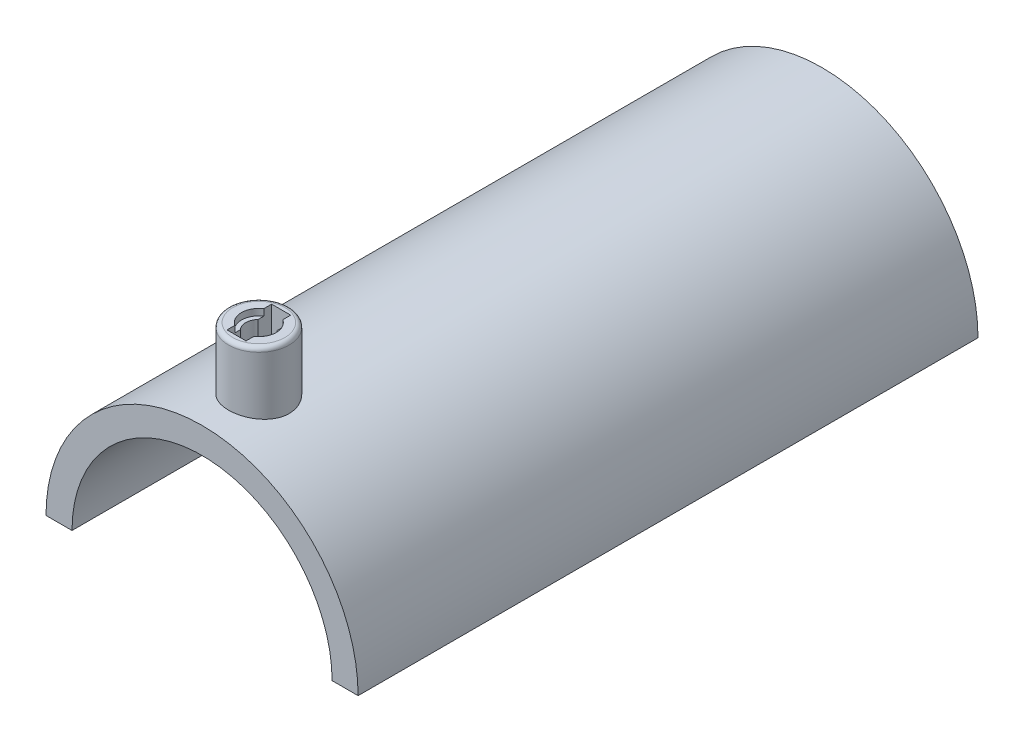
ISO-10303-21;
HEADER;
FILE_DESCRIPTION(('STEP AP214'),'2;1');
FILE_NAME('part.step','',(''),(''),'','','');
FILE_SCHEMA(('AUTOMOTIVE_DESIGN { 1 0 10303 214 1 1 1 1 }'));
ENDSEC;
DATA;
#1=APPLICATION_CONTEXT('core data for automotive mechanical design processes');
#2=APPLICATION_PROTOCOL_DEFINITION('international standard','automotive_design',2000,#1);
#3=PRODUCT_CONTEXT('',#1,'mechanical');
#4=PRODUCT('Part','Part','',(#3));
#5=PRODUCT_RELATED_PRODUCT_CATEGORY('part','',(#4));
#6=PRODUCT_DEFINITION_FORMATION('','',#4);
#7=PRODUCT_DEFINITION_CONTEXT('part definition',#1,'design');
#8=PRODUCT_DEFINITION('design','',#6,#7);
#9=PRODUCT_DEFINITION_SHAPE('','',#8);
#10=(LENGTH_UNIT() NAMED_UNIT(*) SI_UNIT(.MILLI.,.METRE.));
#11=(NAMED_UNIT(*) PLANE_ANGLE_UNIT() SI_UNIT($,.RADIAN.));
#12=(NAMED_UNIT(*) SI_UNIT($,.STERADIAN.) SOLID_ANGLE_UNIT());
#13=UNCERTAINTY_MEASURE_WITH_UNIT(LENGTH_MEASURE(1.E-05),#10,'distance_accuracy_value','');
#14=(GEOMETRIC_REPRESENTATION_CONTEXT(3) GLOBAL_UNCERTAINTY_ASSIGNED_CONTEXT((#13)) GLOBAL_UNIT_ASSIGNED_CONTEXT((#10,
#11,#12)) REPRESENTATION_CONTEXT('',''));
#15=CARTESIAN_POINT('',(0.,0.,0.));
#16=DIRECTION('',(0.,0.,1.));
#17=DIRECTION('',(1.,0.,0.));
#18=AXIS2_PLACEMENT_3D('',#15,#16,#17);
#19=CARTESIAN_POINT('',(0.,28.,129.9));
#20=DIRECTION('',(0.,1.,0.));
#21=DIRECTION('',(0.,0.,1.));
#22=AXIS2_PLACEMENT_3D('',#19,#20,#21);
#23=CYLINDRICAL_SURFACE('',#22,4.);
#24=CARTESIAN_POINT('',(0.,50.,129.9));
#25=DIRECTION('',(0.,1.,0.));
#26=DIRECTION('',(0.,0.,1.));
#27=AXIS2_PLACEMENT_3D('',#24,#25,#26);
#28=CIRCLE('',#27,4.);
#29=CARTESIAN_POINT('',(2.19999999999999,50.,133.240658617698));
#30=VERTEX_POINT('',#29);
#31=CARTESIAN_POINT('',(2.19999999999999,50.,126.559341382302));
#32=VERTEX_POINT('',#31);
#33=EDGE_CURVE('E425',#30,#32,#28,.T.);
#34=ORIENTED_EDGE('',*,*,#33,.T.);
#35=DIRECTION('',(0.,1.,0.));
#36=VECTOR('',#35,1.);
#37=CARTESIAN_POINT('',(2.19999999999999,28.,126.559341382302));
#38=LINE('',#37,#36);
#39=CARTESIAN_POINT('',(2.19999999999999,48.5,126.559341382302));
#40=VERTEX_POINT('',#39);
#41=EDGE_CURVE('E401',#32,#40,#38,.F.);
#42=ORIENTED_EDGE('',*,*,#41,.T.);
#43=CARTESIAN_POINT('',(0.,48.5,129.9));
#44=DIRECTION('',(0.,1.,0.));
#45=DIRECTION('',(0.,0.,1.));
#46=AXIS2_PLACEMENT_3D('',#43,#44,#45);
#47=CIRCLE('',#46,4.);
#48=CARTESIAN_POINT('',(2.19999999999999,48.5,133.240658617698));
#49=VERTEX_POINT('',#48);
#50=EDGE_CURVE('E419',#40,#49,#47,.F.);
#51=ORIENTED_EDGE('',*,*,#50,.T.);
#52=DIRECTION('',(0.,1.,0.));
#53=VECTOR('',#52,1.);
#54=CARTESIAN_POINT('',(2.19999999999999,28.,133.240658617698));
#55=LINE('',#54,#53);
#56=EDGE_CURVE('E394',#49,#30,#55,.T.);
#57=ORIENTED_EDGE('',*,*,#56,.T.);
#58=EDGE_LOOP('',(#34,#42,#51,#57));
#59=FACE_BOUND('',#58,.T.);
#60=ADVANCED_FACE('F35',(#59),#23,.F.);
#61=CARTESIAN_POINT('',(0.,44.5,129.9));
#62=DIRECTION('',(0.,1.,0.));
#63=DIRECTION('',(0.,0.,1.));
#64=AXIS2_PLACEMENT_3D('',#61,#62,#63);
#65=PLANE('',#64);
#66=CARTESIAN_POINT('',(0.,44.5,129.9));
#67=DIRECTION('',(0.,1.,0.));
#68=DIRECTION('',(0.,0.,1.));
#69=AXIS2_PLACEMENT_3D('',#66,#67,#68);
#70=CIRCLE('',#69,4.);
#71=CARTESIAN_POINT('',(2.19999999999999,44.5,126.559341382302));
#72=VERTEX_POINT('',#71);
#73=CARTESIAN_POINT('',(2.19999999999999,44.5,133.240658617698));
#74=VERTEX_POINT('',#73);
#75=EDGE_CURVE('E874',#72,#74,#70,.F.);
#76=ORIENTED_EDGE('',*,*,#75,.T.);
#77=DIRECTION('',(0.,0.,-1.));
#78=VECTOR('',#77,1.);
#79=CARTESIAN_POINT('',(2.19999999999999,44.5,129.9));
#80=LINE('',#79,#78);
#81=CARTESIAN_POINT('',(2.19999999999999,44.5,131.939607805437));
#82=VERTEX_POINT('',#81);
#83=EDGE_CURVE('E390',#74,#82,#80,.T.);
#84=ORIENTED_EDGE('',*,*,#83,.T.);
#85=CARTESIAN_POINT('',(0.,44.5,129.9));
#86=DIRECTION('',(0.,1.,0.));
#87=DIRECTION('',(0.,0.,1.));
#88=AXIS2_PLACEMENT_3D('',#85,#86,#87);
#89=CIRCLE('',#88,3.);
#90=CARTESIAN_POINT('',(2.19999999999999,44.5,127.860392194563));
#91=VERTEX_POINT('',#90);
#92=EDGE_CURVE('E416',#82,#91,#89,.T.);
#93=ORIENTED_EDGE('',*,*,#92,.T.);
#94=EDGE_CURVE('E395',#91,#72,#80,.T.);
#95=ORIENTED_EDGE('',*,*,#94,.T.);
#96=EDGE_LOOP('',(#76,#84,#93,#95));
#97=FACE_BOUND('',#96,.T.);
#98=ADVANCED_FACE('F591',(#97),#65,.F.);
#99=CARTESIAN_POINT('',(0.,48.5,129.9));
#100=DIRECTION('',(0.,1.,0.));
#101=DIRECTION('',(0.,0.,1.));
#102=AXIS2_PLACEMENT_3D('',#99,#100,#101);
#103=PLANE('',#102);
#104=DIRECTION('',(0.,0.,-1.));
#105=VECTOR('',#104,1.);
#106=CARTESIAN_POINT('',(2.19999999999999,48.5,129.9));
#107=LINE('',#106,#105);
#108=CARTESIAN_POINT('',(2.19999999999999,48.5,131.939607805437));
#109=VERTEX_POINT('',#108);
#110=EDGE_CURVE('E388',#49,#109,#107,.T.);
#111=ORIENTED_EDGE('',*,*,#110,.F.);
#112=ORIENTED_EDGE('',*,*,#50,.F.);
#113=CARTESIAN_POINT('',(2.19999999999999,48.5,127.860392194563));
#114=VERTEX_POINT('',#113);
#115=EDGE_CURVE('E391',#114,#40,#107,.T.);
#116=ORIENTED_EDGE('',*,*,#115,.F.);
#117=CARTESIAN_POINT('',(0.,48.5,129.9));
#118=DIRECTION('',(0.,1.,0.));
#119=DIRECTION('',(0.,0.,1.));
#120=AXIS2_PLACEMENT_3D('',#117,#118,#119);
#121=CIRCLE('',#120,3.);
#122=EDGE_CURVE('E421',#109,#114,#121,.T.);
#123=ORIENTED_EDGE('',*,*,#122,.F.);
#124=EDGE_LOOP('',(#111,#112,#116,#123));
#125=FACE_BOUND('',#124,.T.);
#126=ADVANCED_FACE('F598',(#125),#103,.T.);
#127=CARTESIAN_POINT('',(0.,44.5,129.9));
#128=DIRECTION('',(0.,1.,0.));
#129=DIRECTION('',(0.,0.,1.));
#130=AXIS2_PLACEMENT_3D('',#127,#128,#129);
#131=CYLINDRICAL_SURFACE('',#130,3.);
#132=ORIENTED_EDGE('',*,*,#122,.T.);
#133=DIRECTION('',(0.,1.,0.));
#134=VECTOR('',#133,1.);
#135=CARTESIAN_POINT('',(2.19999999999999,44.5,127.860392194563));
#136=LINE('',#135,#134);
#137=EDGE_CURVE('E890',#114,#91,#136,.F.);
#138=ORIENTED_EDGE('',*,*,#137,.T.);
#139=ORIENTED_EDGE('',*,*,#92,.F.);
#140=DIRECTION('',(0.,1.,0.));
#141=VECTOR('',#140,1.);
#142=CARTESIAN_POINT('',(2.19999999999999,44.5,131.939607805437));
#143=LINE('',#142,#141);
#144=EDGE_CURVE('E887',#82,#109,#143,.T.);
#145=ORIENTED_EDGE('',*,*,#144,.T.);
#146=EDGE_LOOP('',(#132,#138,#139,#145));
#147=FACE_BOUND('',#146,.T.);
#148=ADVANCED_FACE('F602',(#147),#131,.F.);
#149=CARTESIAN_POINT('',(0.,30.,129.9));
#150=DIRECTION('',(0.,1.,0.));
#151=DIRECTION('',(0.,0.,1.));
#152=AXIS2_PLACEMENT_3D('',#149,#150,#151);
#153=CIRCLE('',#152,4.);
#154=CARTESIAN_POINT('',(0.,30.,133.9));
#155=VERTEX_POINT('',#154);
#156=CARTESIAN_POINT('',(0.,30.,125.9));
#157=VERTEX_POINT('',#156);
#158=EDGE_CURVE('E415',#155,#157,#153,.F.);
#159=ORIENTED_EDGE('',*,*,#158,.F.);
#160=CARTESIAN_POINT('',(0.,30.,133.9));
#161=CARTESIAN_POINT('',(0.223617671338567,29.9999967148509,133.899990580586));
#162=CARTESIAN_POINT('',(0.447371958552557,29.9974734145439,133.881184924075));
#163=CARTESIAN_POINT('',(0.888645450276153,29.9876502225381,133.806467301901));
#164=CARTESIAN_POINT('',(1.10615804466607,29.9803454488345,133.750517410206));
#165=CARTESIAN_POINT('',(1.52849662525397,29.9617815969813,133.603196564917));
#166=CARTESIAN_POINT('',(1.73333136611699,29.9505252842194,133.511850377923));
#167=CARTESIAN_POINT('',(2.1247277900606,29.9253077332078,133.296386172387));
#168=CARTESIAN_POINT('',(2.31129241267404,29.9113469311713,133.172273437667));
#169=CARTESIAN_POINT('',(2.66205164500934,29.8821798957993,132.893973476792));
#170=CARTESIAN_POINT('',(2.82611597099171,29.8669671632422,132.739622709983));
#171=CARTESIAN_POINT('',(3.12609471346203,29.837062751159,132.405579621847));
#172=CARTESIAN_POINT('',(3.26200763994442,29.8223710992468,132.225885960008));
#173=CARTESIAN_POINT('',(3.50231804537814,29.7951087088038,131.84540175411));
#174=CARTESIAN_POINT('',(3.60659214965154,29.7825463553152,131.644532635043));
#175=CARTESIAN_POINT('',(3.77987690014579,29.7610517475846,131.227937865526));
#176=CARTESIAN_POINT('',(3.84888906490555,29.7521193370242,131.012212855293));
#177=CARTESIAN_POINT('',(3.94929213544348,29.7389587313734,130.573388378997));
#178=CARTESIAN_POINT('',(3.98090408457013,29.7347029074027,130.350340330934));
#179=CARTESIAN_POINT('',(4.00629361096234,29.7312930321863,129.902067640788));
#180=CARTESIAN_POINT('',(4.00007291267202,29.732138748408,129.676843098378));
#181=CARTESIAN_POINT('',(3.95015491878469,29.7388111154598,129.232157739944));
#182=CARTESIAN_POINT('',(3.90670195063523,29.7446052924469,129.012668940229));
#183=CARTESIAN_POINT('',(3.78393449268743,29.7604710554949,128.58412632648));
#184=CARTESIAN_POINT('',(3.70461918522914,29.7705427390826,128.37507275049));
#185=CARTESIAN_POINT('',(3.51211858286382,29.7938652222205,127.972580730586));
#186=CARTESIAN_POINT('',(3.39882795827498,29.807125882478,127.779193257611));
#187=CARTESIAN_POINT('',(3.14166786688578,29.8353247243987,127.414081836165));
#188=CARTESIAN_POINT('',(2.99779681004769,29.8502629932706,127.242359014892));
#189=CARTESIAN_POINT('',(2.68220980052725,29.8802779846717,126.924033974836));
#190=CARTESIAN_POINT('',(2.51028341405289,29.895354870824,126.777640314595));
#191=CARTESIAN_POINT('',(2.14418834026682,29.9238384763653,126.515755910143));
#192=CARTESIAN_POINT('',(1.95001958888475,29.9372451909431,126.400265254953));
#193=CARTESIAN_POINT('',(1.54478443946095,29.9608878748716,126.203461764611));
#194=CARTESIAN_POINT('',(1.33371115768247,29.9711225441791,126.122162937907));
#195=CARTESIAN_POINT('',(0.90074184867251,29.9872565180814,125.996221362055));
#196=CARTESIAN_POINT('',(0.678846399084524,29.9931560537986,125.951576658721));
#197=CARTESIAN_POINT('',(0.232333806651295,29.9999248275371,125.900483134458));
#198=CARTESIAN_POINT('',(0.00775006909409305,30.0008318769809,125.893747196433));
#199=CARTESIAN_POINT('',(-0.439343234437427,29.9976158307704,125.917903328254));
#200=CARTESIAN_POINT('',(-0.661852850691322,29.993492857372,125.948794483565));
#201=CARTESIAN_POINT('',(-1.09762743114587,29.980703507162,126.047089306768));
#202=CARTESIAN_POINT('',(-1.31092403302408,29.9720542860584,126.114355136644));
#203=CARTESIAN_POINT('',(-1.72321019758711,29.9511801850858,126.283345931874));
#204=CARTESIAN_POINT('',(-1.92219921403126,29.9389551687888,126.385072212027));
#205=CARTESIAN_POINT('',(-2.30149775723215,29.9121967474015,126.620784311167));
#206=CARTESIAN_POINT('',(-2.4816916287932,29.8976503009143,126.754954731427));
#207=CARTESIAN_POINT('',(-2.81710589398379,29.8679145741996,127.051486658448));
#208=CARTESIAN_POINT('',(-2.97232515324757,29.8527252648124,127.213849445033));
#209=CARTESIAN_POINT('',(-3.25441098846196,29.8232980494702,127.563426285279));
#210=CARTESIAN_POINT('',(-3.38108655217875,29.809066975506,127.750795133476));
#211=CARTESIAN_POINT('',(-3.60116702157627,29.7832826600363,128.144318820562));
#212=CARTESIAN_POINT('',(-3.69457267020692,29.7717293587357,128.350473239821));
#213=CARTESIAN_POINT('',(-3.84515673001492,29.7526562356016,128.775114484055));
#214=CARTESIAN_POINT('',(-3.90244057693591,29.745124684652,128.993563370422));
#215=CARTESIAN_POINT('',(-3.97949334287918,29.7349149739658,129.437087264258));
#216=CARTESIAN_POINT('',(-3.99926426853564,29.7322365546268,129.662161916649));
#217=CARTESIAN_POINT('',(-4.00068971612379,29.732044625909,130.110646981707));
#218=CARTESIAN_POINT('',(-3.98264438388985,29.7344904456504,130.334056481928));
#219=CARTESIAN_POINT('',(-3.90958753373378,29.744183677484,130.774635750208));
#220=CARTESIAN_POINT('',(-3.85457602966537,29.7514310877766,130.991805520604));
#221=CARTESIAN_POINT('',(-3.70924620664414,29.7698978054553,131.413687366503));
#222=CARTESIAN_POINT('',(-3.61894441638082,29.781115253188,131.618405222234));
#223=CARTESIAN_POINT('',(-3.40562685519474,29.8062609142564,132.009831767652));
#224=CARTESIAN_POINT('',(-3.28261045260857,29.820189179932,132.196540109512));
#225=CARTESIAN_POINT('',(-3.00624897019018,29.8493193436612,132.548179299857));
#226=CARTESIAN_POINT('',(-2.85268054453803,29.8645301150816,132.71293389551));
#227=CARTESIAN_POINT('',(-2.52004338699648,29.8944343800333,133.014446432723));
#228=CARTESIAN_POINT('',(-2.34096868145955,29.9091277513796,133.1511977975));
#229=CARTESIAN_POINT('',(-1.96150597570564,29.9364127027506,133.393334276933));
#230=CARTESIAN_POINT('',(-1.76102924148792,29.9489949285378,133.49858133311));
#231=CARTESIAN_POINT('',(-1.34518481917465,29.9705464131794,133.67376119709));
#232=CARTESIAN_POINT('',(-1.12983335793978,29.9795195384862,133.74373181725));
#233=CARTESIAN_POINT('',(-0.76117681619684,29.9907144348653,133.82989601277));
#234=CARTESIAN_POINT('',(-0.610182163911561,29.9941792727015,133.856146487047));
#235=CARTESIAN_POINT('',(-0.306146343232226,29.9988231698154,133.891201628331));
#236=CARTESIAN_POINT('',(-0.153105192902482,30.000002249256,133.900006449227));
#237=CARTESIAN_POINT('',(0.,30.,133.9));
#238=B_SPLINE_CURVE_WITH_KNOTS('',3,(#160,#161,#162,#163,#164,#165,#166,#167,#168,#169,#170,
#171,#172,#173,#174,#175,#176,#177,#178,#179,#180,#181,#182,#183,#184,#185,#186,#187,#188,#189,
#190,#191,#192,#193,#194,#195,#196,#197,#198,#199,#200,#201,#202,#203,#204,#205,#206,#207,#208,
#209,#210,#211,#212,#213,#214,#215,#216,#217,#218,#219,#220,#221,#222,#223,#224,#225,#226,#227,
#228,#229,#230,#231,#232,#233,#234,#235,#236,#237),.UNSPECIFIED.,.T.,.F.,(4,2,2,2,2,2,2,2,2,2,2,
2,2,2,2,2,2,2,2,2,2,2,2,2,2,2,2,2,2,2,2,2,2,2,2,2,2,2,4),(0.,0.670293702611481,1.34127286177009,
2.01178338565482,2.68218585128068,3.35631956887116,4.03048895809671,4.70725443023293,
5.38399075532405,6.05670711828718,6.7293928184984,7.39769770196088,8.06601782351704,
8.73643166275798,9.40688036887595,10.082610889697,10.7583433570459,11.4343524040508,
12.1103254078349,12.7811716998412,13.4520016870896,14.1203072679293,14.7886383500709,
15.4608654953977,16.1331231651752,16.809754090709,17.486369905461,18.1610014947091,
18.8355969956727,19.5048585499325,20.1741198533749,20.8430680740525,21.512029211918,
22.1860733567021,22.8602756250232,23.5373905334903,24.2137780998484,24.6727147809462,
25.1316474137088),.UNSPECIFIED.);
#239=EDGE_CURVE('E428',#157,#155,#238,.T.);
#240=ORIENTED_EDGE('',*,*,#239,.F.);
#241=EDGE_LOOP('',(#159,#240));
#242=FACE_BOUND('',#241,.T.);
#243=ADVANCED_FACE('F593',(#242),#23,.F.);
#244=EDGE_CURVE('E410',#157,#155,#153,.F.);
#245=ORIENTED_EDGE('',*,*,#244,.F.);
#246=EDGE_CURVE('E430',#155,#157,#238,.T.);
#247=ORIENTED_EDGE('',*,*,#246,.F.);
#248=EDGE_LOOP('',(#245,#247));
#249=FACE_BOUND('',#248,.T.);
#250=ADVANCED_FACE('F601',(#249),#23,.F.);
#251=ORIENTED_EDGE('',*,*,#75,.F.);
#252=DIRECTION('',(0.,1.,0.));
#253=VECTOR('',#252,1.);
#254=CARTESIAN_POINT('',(2.19999999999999,28.,126.559341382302));
#255=LINE('',#254,#253);
#256=CARTESIAN_POINT('',(2.19999999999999,39.,126.559341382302));
#257=VERTEX_POINT('',#256);
#258=EDGE_CURVE('E404',#72,#257,#255,.F.);
#259=ORIENTED_EDGE('',*,*,#258,.T.);
#260=CARTESIAN_POINT('',(0.,39.,129.9));
#261=DIRECTION('',(0.,1.,0.));
#262=DIRECTION('',(0.,0.,1.));
#263=AXIS2_PLACEMENT_3D('',#260,#261,#262);
#264=CIRCLE('',#263,4.);
#265=CARTESIAN_POINT('',(-2.20000000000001,39.,126.559341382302));
#266=VERTEX_POINT('',#265);
#267=EDGE_CURVE('E329',#266,#257,#264,.F.);
#268=ORIENTED_EDGE('',*,*,#267,.F.);
#269=DIRECTION('',(0.,1.,0.));
#270=VECTOR('',#269,1.);
#271=CARTESIAN_POINT('',(-2.20000000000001,28.,126.559341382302));
#272=LINE('',#271,#270);
#273=CARTESIAN_POINT('',(-2.20000000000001,44.5,126.559341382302));
#274=VERTEX_POINT('',#273);
#275=EDGE_CURVE('E379',#266,#274,#272,.T.);
#276=ORIENTED_EDGE('',*,*,#275,.T.);
#277=CARTESIAN_POINT('',(-2.20000000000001,44.5,133.240658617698));
#278=VERTEX_POINT('',#277);
#279=EDGE_CURVE('E878',#278,#274,#70,.F.);
#280=ORIENTED_EDGE('',*,*,#279,.F.);
#281=DIRECTION('',(0.,1.,0.));
#282=VECTOR('',#281,1.);
#283=CARTESIAN_POINT('',(-2.20000000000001,28.,133.240658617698));
#284=LINE('',#283,#282);
#285=CARTESIAN_POINT('',(-2.20000000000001,39.,133.240658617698));
#286=VERTEX_POINT('',#285);
#287=EDGE_CURVE('E385',#278,#286,#284,.F.);
#288=ORIENTED_EDGE('',*,*,#287,.T.);
#289=CARTESIAN_POINT('',(2.19999999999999,39.,133.240658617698));
#290=VERTEX_POINT('',#289);
#291=EDGE_CURVE('E893',#290,#286,#264,.F.);
#292=ORIENTED_EDGE('',*,*,#291,.F.);
#293=DIRECTION('',(0.,1.,0.));
#294=VECTOR('',#293,1.);
#295=CARTESIAN_POINT('',(2.19999999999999,28.,133.240658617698));
#296=LINE('',#295,#294);
#297=EDGE_CURVE('E398',#290,#74,#296,.T.);
#298=ORIENTED_EDGE('',*,*,#297,.T.);
#299=EDGE_LOOP('',(#251,#259,#268,#276,#280,#288,#292,#298));
#300=FACE_BOUND('',#299,.T.);
#301=CARTESIAN_POINT('',(0.,34.,129.9));
#302=DIRECTION('',(0.,1.,0.));
#303=DIRECTION('',(0.,0.,1.));
#304=AXIS2_PLACEMENT_3D('',#301,#302,#303);
#305=CIRCLE('',#304,4.);
#306=CARTESIAN_POINT('',(0.,34.,133.9));
#307=VERTEX_POINT('',#306);
#308=EDGE_CURVE('E618',#307,#307,#305,.F.);
#309=ORIENTED_EDGE('',*,*,#308,.T.);
#310=EDGE_LOOP('',(#309));
#311=FACE_BOUND('',#310,.T.);
#312=ADVANCED_FACE('F455',(#300,#311),#23,.F.);
#313=CARTESIAN_POINT('',(0.,0.,125.));
#314=DIRECTION('',(0.,0.,-1.));
#315=DIRECTION('',(-1.,0.,0.));
#316=AXIS2_PLACEMENT_3D('',#313,#314,#315);
#317=CYLINDRICAL_SURFACE('',#316,36.);
#318=CARTESIAN_POINT('',(0.,0.,41.));
#319=DIRECTION('',(0.,0.,-1.));
#320=DIRECTION('',(1.,0.,0.));
#321=AXIS2_PLACEMENT_3D('',#318,#319,#320);
#322=CIRCLE('',#321,36.);
#323=CARTESIAN_POINT('',(-35.9690986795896,1.49128809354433,41.));
#324=VERTEX_POINT('',#323);
#325=CARTESIAN_POINT('',(-35.7054429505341,4.5957963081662,41.));
#326=VERTEX_POINT('',#325);
#327=EDGE_CURVE('E713',#324,#326,#322,.T.);
#328=ORIENTED_EDGE('',*,*,#327,.F.);
#329=DIRECTION('',(0.,0.,-1.));
#330=VECTOR('',#329,1.);
#331=CARTESIAN_POINT('',(-35.9690986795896,1.49128809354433,41.));
#332=LINE('',#331,#330);
#333=CARTESIAN_POINT('',(-35.9690986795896,1.49128809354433,36.));
#334=VERTEX_POINT('',#333);
#335=EDGE_CURVE('E738',#324,#334,#332,.T.);
#336=ORIENTED_EDGE('',*,*,#335,.T.);
#337=CARTESIAN_POINT('',(0.,0.,36.));
#338=DIRECTION('',(0.,0.,-1.));
#339=DIRECTION('',(1.,0.,0.));
#340=AXIS2_PLACEMENT_3D('',#337,#338,#339);
#341=CIRCLE('',#340,36.);
#342=CARTESIAN_POINT('',(-35.7054429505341,4.5957963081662,36.));
#343=VERTEX_POINT('',#342);
#344=EDGE_CURVE('E722',#334,#343,#341,.T.);
#345=ORIENTED_EDGE('',*,*,#344,.T.);
#346=DIRECTION('',(0.,0.,-1.));
#347=VECTOR('',#346,1.);
#348=CARTESIAN_POINT('',(-35.7054429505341,4.5957963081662,41.));
#349=LINE('',#348,#347);
#350=EDGE_CURVE('E741',#326,#343,#349,.T.);
#351=ORIENTED_EDGE('',*,*,#350,.F.);
#352=EDGE_LOOP('',(#328,#336,#345,#351));
#353=FACE_BOUND('',#352,.T.);
#354=CARTESIAN_POINT('',(0.,0.,106.));
#355=DIRECTION('',(0.,0.,-1.));
#356=DIRECTION('',(1.,0.,0.));
#357=AXIS2_PLACEMENT_3D('',#354,#355,#356);
#358=CIRCLE('',#357,36.);
#359=CARTESIAN_POINT('',(-35.9690986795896,1.49128809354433,106.));
#360=VERTEX_POINT('',#359);
#361=CARTESIAN_POINT('',(-35.7054429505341,4.5957963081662,106.));
#362=VERTEX_POINT('',#361);
#363=EDGE_CURVE('E767',#360,#362,#358,.T.);
#364=ORIENTED_EDGE('',*,*,#363,.F.);
#365=DIRECTION('',(0.,0.,-1.));
#366=VECTOR('',#365,1.);
#367=CARTESIAN_POINT('',(-35.9690986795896,1.49128809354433,106.));
#368=LINE('',#367,#366);
#369=CARTESIAN_POINT('',(-35.9690986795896,1.49128809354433,101.));
#370=VERTEX_POINT('',#369);
#371=EDGE_CURVE('E792',#360,#370,#368,.T.);
#372=ORIENTED_EDGE('',*,*,#371,.T.);
#373=CARTESIAN_POINT('',(0.,0.,101.));
#374=DIRECTION('',(0.,0.,-1.));
#375=DIRECTION('',(1.,0.,0.));
#376=AXIS2_PLACEMENT_3D('',#373,#374,#375);
#377=CIRCLE('',#376,36.);
#378=CARTESIAN_POINT('',(-35.7054429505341,4.5957963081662,101.));
#379=VERTEX_POINT('',#378);
#380=EDGE_CURVE('E776',#370,#379,#377,.T.);
#381=ORIENTED_EDGE('',*,*,#380,.T.);
#382=DIRECTION('',(0.,0.,-1.));
#383=VECTOR('',#382,1.);
#384=CARTESIAN_POINT('',(-35.7054429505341,4.5957963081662,106.));
#385=LINE('',#384,#383);
#386=EDGE_CURVE('E795',#362,#379,#385,.T.);
#387=ORIENTED_EDGE('',*,*,#386,.F.);
#388=EDGE_LOOP('',(#364,#372,#381,#387));
#389=FACE_BOUND('',#388,.T.);
#390=CARTESIAN_POINT('',(0.,0.,84.));
#391=DIRECTION('',(0.,0.,-1.));
#392=DIRECTION('',(1.,0.,0.));
#393=AXIS2_PLACEMENT_3D('',#390,#391,#392);
#394=CIRCLE('',#393,36.);
#395=CARTESIAN_POINT('',(-35.9690986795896,1.49128809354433,84.));
#396=VERTEX_POINT('',#395);
#397=CARTESIAN_POINT('',(-35.7054429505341,4.5957963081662,84.));
#398=VERTEX_POINT('',#397);
#399=EDGE_CURVE('E809',#396,#398,#394,.T.);
#400=ORIENTED_EDGE('',*,*,#399,.T.);
#401=DIRECTION('',(0.,0.,1.));
#402=VECTOR('',#401,1.);
#403=CARTESIAN_POINT('',(-35.7054429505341,4.5957963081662,84.));
#404=LINE('',#403,#402);
#405=CARTESIAN_POINT('',(-35.7054429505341,4.5957963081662,89.));
#406=VERTEX_POINT('',#405);
#407=EDGE_CURVE('E829',#398,#406,#404,.T.);
#408=ORIENTED_EDGE('',*,*,#407,.T.);
#409=CARTESIAN_POINT('',(0.,0.,89.));
#410=DIRECTION('',(0.,0.,-1.));
#411=DIRECTION('',(1.,0.,0.));
#412=AXIS2_PLACEMENT_3D('',#409,#410,#411);
#413=CIRCLE('',#412,36.);
#414=CARTESIAN_POINT('',(-35.9690986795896,1.49128809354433,89.));
#415=VERTEX_POINT('',#414);
#416=EDGE_CURVE('E822',#415,#406,#413,.T.);
#417=ORIENTED_EDGE('',*,*,#416,.F.);
#418=DIRECTION('',(0.,0.,1.));
#419=VECTOR('',#418,1.);
#420=CARTESIAN_POINT('',(-35.9690986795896,1.49128809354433,84.));
#421=LINE('',#420,#419);
#422=EDGE_CURVE('E832',#396,#415,#421,.T.);
#423=ORIENTED_EDGE('',*,*,#422,.F.);
#424=EDGE_LOOP('',(#400,#408,#417,#423));
#425=FACE_BOUND('',#424,.T.);
#426=DIRECTION('',(0.,0.,-1.));
#427=VECTOR('',#426,1.);
#428=CARTESIAN_POINT('',(-36.,0.,125.));
#429=LINE('',#428,#427);
#430=CARTESIAN_POINT('',(-36.,0.,143.));
#431=VERTEX_POINT('',#430);
#432=CARTESIAN_POINT('',(-36.,0.,0.));
#433=VERTEX_POINT('',#432);
#434=EDGE_CURVE('E734',#431,#433,#429,.T.);
#435=ORIENTED_EDGE('',*,*,#434,.F.);
#436=CARTESIAN_POINT('',(0.,0.,143.));
#437=DIRECTION('',(0.,0.,1.));
#438=DIRECTION('',(1.,0.,0.));
#439=AXIS2_PLACEMENT_3D('',#436,#437,#438);
#440=CIRCLE('',#439,36.);
#441=CARTESIAN_POINT('',(36.,0.,143.));
#442=VERTEX_POINT('',#441);
#443=EDGE_CURVE('E912',#442,#431,#440,.T.);
#444=ORIENTED_EDGE('',*,*,#443,.F.);
#445=DIRECTION('',(0.,0.,1.));
#446=VECTOR('',#445,1.);
#447=CARTESIAN_POINT('',(36.,0.,0.));
#448=LINE('',#447,#446);
#449=CARTESIAN_POINT('',(36.,0.,0.));
#450=VERTEX_POINT('',#449);
#451=EDGE_CURVE('E646',#450,#442,#448,.T.);
#452=ORIENTED_EDGE('',*,*,#451,.F.);
#453=CARTESIAN_POINT('',(0.,0.,0.));
#454=DIRECTION('',(0.,0.,1.));
#455=DIRECTION('',(1.,0.,0.));
#456=AXIS2_PLACEMENT_3D('',#453,#454,#455);
#457=CIRCLE('',#456,36.);
#458=EDGE_CURVE('E841',#450,#433,#457,.T.);
#459=ORIENTED_EDGE('',*,*,#458,.T.);
#460=EDGE_LOOP('',(#435,#444,#452,#459));
#461=FACE_BOUND('',#460,.T.);
#462=CARTESIAN_POINT('',(0.,0.,19.));
#463=DIRECTION('',(0.,0.,-1.));
#464=DIRECTION('',(1.,0.,0.));
#465=AXIS2_PLACEMENT_3D('',#462,#463,#464);
#466=CIRCLE('',#465,36.);
#467=CARTESIAN_POINT('',(-35.9690986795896,1.49128809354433,19.));
#468=VERTEX_POINT('',#467);
#469=CARTESIAN_POINT('',(-35.7054429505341,4.5957963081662,19.));
#470=VERTEX_POINT('',#469);
#471=EDGE_CURVE('E676',#468,#470,#466,.T.);
#472=ORIENTED_EDGE('',*,*,#471,.T.);
#473=DIRECTION('',(0.,0.,1.));
#474=VECTOR('',#473,1.);
#475=CARTESIAN_POINT('',(-35.7054429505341,4.5957963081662,19.));
#476=LINE('',#475,#474);
#477=CARTESIAN_POINT('',(-35.7054429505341,4.5957963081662,24.));
#478=VERTEX_POINT('',#477);
#479=EDGE_CURVE('E697',#470,#478,#476,.T.);
#480=ORIENTED_EDGE('',*,*,#479,.T.);
#481=CARTESIAN_POINT('',(0.,0.,24.));
#482=DIRECTION('',(0.,0.,-1.));
#483=DIRECTION('',(1.,0.,0.));
#484=AXIS2_PLACEMENT_3D('',#481,#482,#483);
#485=CIRCLE('',#484,36.);
#486=CARTESIAN_POINT('',(-35.9690986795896,1.49128809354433,24.));
#487=VERTEX_POINT('',#486);
#488=EDGE_CURVE('E689',#487,#478,#485,.T.);
#489=ORIENTED_EDGE('',*,*,#488,.F.);
#490=DIRECTION('',(0.,0.,1.));
#491=VECTOR('',#490,1.);
#492=CARTESIAN_POINT('',(-35.9690986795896,1.49128809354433,19.));
#493=LINE('',#492,#491);
#494=EDGE_CURVE('E700',#468,#487,#493,.T.);
#495=ORIENTED_EDGE('',*,*,#494,.F.);
#496=EDGE_LOOP('',(#472,#480,#489,#495));
#497=FACE_BOUND('',#496,.T.);
#498=CARTESIAN_POINT('',(0.,36.0000000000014,136.9));
#499=CARTESIAN_POINT('',(-0.194696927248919,36.0000018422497,136.90000371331));
#500=CARTESIAN_POINT('',(-0.389346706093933,35.9984177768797,136.891874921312));
#501=CARTESIAN_POINT('',(-0.777300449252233,35.992129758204,136.859430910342));
#502=CARTESIAN_POINT('',(-0.970604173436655,35.9874252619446,136.835112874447));
#503=CARTESIAN_POINT('',(-1.35451563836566,35.9750220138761,136.770459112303));
#504=CARTESIAN_POINT('',(-1.54512187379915,35.9673216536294,136.730114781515));
#505=CARTESIAN_POINT('',(-1.92225624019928,35.9491388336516,136.633708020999));
#506=CARTESIAN_POINT('',(-2.10878284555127,35.9386553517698,136.577639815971));
#507=CARTESIAN_POINT('',(-2.47613488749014,35.915213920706,136.450305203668));
#508=CARTESIAN_POINT('',(-2.65696750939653,35.9022592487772,136.379058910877));
#509=CARTESIAN_POINT('',(-3.01201336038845,35.8742177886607,136.221826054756));
#510=CARTESIAN_POINT('',(-3.18622411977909,35.859130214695,136.135834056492));
#511=CARTESIAN_POINT('',(-3.52670112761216,35.8272466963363,135.949793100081));
#512=CARTESIAN_POINT('',(-3.69297095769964,35.8104515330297,135.849750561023));
#513=CARTESIAN_POINT('',(-4.01660459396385,35.7755977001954,135.636242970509));
#514=CARTESIAN_POINT('',(-4.1739650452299,35.7575385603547,135.522772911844));
#515=CARTESIAN_POINT('',(-4.48037219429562,35.7204472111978,135.281882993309));
#516=CARTESIAN_POINT('',(-4.6293068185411,35.7014064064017,135.154321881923));
#517=CARTESIAN_POINT('',(-4.91598971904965,35.6630617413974,134.88712889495));
#518=CARTESIAN_POINT('',(-5.05373383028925,35.64375778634,134.747492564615));
#519=CARTESIAN_POINT('',(-5.31700257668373,35.6054374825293,134.457177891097));
#520=CARTESIAN_POINT('',(-5.44253076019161,35.5864210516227,134.306502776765));
#521=CARTESIAN_POINT('',(-5.68059389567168,35.5491965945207,133.995032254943));
#522=CARTESIAN_POINT('',(-5.79312403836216,35.5309888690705,133.83423313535));
#523=CARTESIAN_POINT('',(-6.00523464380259,35.4957577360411,133.502260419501));
#524=CARTESIAN_POINT('',(-6.10469840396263,35.4787455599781,133.331011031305));
#525=CARTESIAN_POINT('',(-6.28882453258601,35.4465714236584,132.980562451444));
#526=CARTESIAN_POINT('',(-6.37348682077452,35.4314094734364,132.801363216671));
#527=CARTESIAN_POINT('',(-6.52736226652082,35.4033848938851,132.436291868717));
#528=CARTESIAN_POINT('',(-6.59657670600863,35.3905220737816,132.250420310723));
#529=CARTESIAN_POINT('',(-6.71902591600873,35.3674790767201,131.873319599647));
#530=CARTESIAN_POINT('',(-6.77226053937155,35.3572989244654,131.682090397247));
#531=CARTESIAN_POINT('',(-6.86175396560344,35.3400394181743,131.298106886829));
#532=CARTESIAN_POINT('',(-6.89821816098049,35.3329226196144,131.105402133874));
#533=CARTESIAN_POINT('',(-6.95486929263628,35.3218151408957,130.717459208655));
#534=CARTESIAN_POINT('',(-6.97505060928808,35.3178255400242,130.52222018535));
#535=CARTESIAN_POINT('',(-6.99893968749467,35.3130996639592,130.130771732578));
#536=CARTESIAN_POINT('',(-7.00265483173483,35.3123619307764,129.934562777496));
#537=CARTESIAN_POINT('',(-6.99362053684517,35.3141506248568,129.542519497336));
#538=CARTESIAN_POINT('',(-6.980865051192,35.3166782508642,129.346685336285));
#539=CARTESIAN_POINT('',(-6.91856759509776,35.3289629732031,128.767607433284));
#540=CARTESIAN_POINT('',(-6.84535155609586,35.3433530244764,128.386722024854));
#541=CARTESIAN_POINT('',(-6.63740414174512,35.3829878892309,127.642959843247));
#542=CARTESIAN_POINT('',(-6.50266997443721,35.4082331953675,127.280083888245));
#543=CARTESIAN_POINT('',(-6.17461675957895,35.4669133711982,126.57967991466));
#544=CARTESIAN_POINT('',(-5.98092738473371,35.5003997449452,126.242329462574));
#545=CARTESIAN_POINT('',(-5.54072341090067,35.5717576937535,125.604585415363));
#546=CARTESIAN_POINT('',(-5.29420306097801,35.609629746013,125.304195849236));
#547=CARTESIAN_POINT('',(-4.75035875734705,35.686280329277,124.743531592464));
#548=CARTESIAN_POINT('',(-4.45224328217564,35.7250633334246,124.484024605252));
#549=CARTESIAN_POINT('',(-3.81630968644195,35.7985763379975,124.018584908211));
#550=CARTESIAN_POINT('',(-3.47849110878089,35.8333062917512,123.812652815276));
#551=CARTESIAN_POINT('',(-2.77191139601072,35.8948783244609,123.460078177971));
#552=CARTESIAN_POINT('',(-2.40310721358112,35.9217091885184,123.313519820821));
#553=CARTESIAN_POINT('',(-1.64547538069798,35.9643741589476,123.084652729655));
#554=CARTESIAN_POINT('',(-1.25665002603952,35.9802095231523,123.002336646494));
#555=CARTESIAN_POINT('',(-0.476614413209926,35.9989251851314,122.905369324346));
#556=CARTESIAN_POINT('',(-0.0855395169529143,36.0020067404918,122.889666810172));
#557=CARTESIAN_POINT('',(0.69364677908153,35.995425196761,122.923546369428));
#558=CARTESIAN_POINT('',(1.08175833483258,35.9857627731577,122.973124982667));
#559=CARTESIAN_POINT('',(1.8406350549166,35.9549046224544,123.135285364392));
#560=CARTESIAN_POINT('',(2.21151910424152,35.9338070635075,123.247331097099));
#561=CARTESIAN_POINT('',(2.92923676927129,35.8824350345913,123.530663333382));
#562=CARTESIAN_POINT('',(3.27606865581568,35.852159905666,123.701954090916));
#563=CARTESIAN_POINT('',(3.94029296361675,35.7852894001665,124.101206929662));
#564=CARTESIAN_POINT('',(4.25729521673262,35.7486244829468,124.329806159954));
#565=CARTESIAN_POINT('',(4.84882040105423,35.6732115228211,124.83634889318));
#566=CARTESIAN_POINT('',(5.12333903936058,35.6344632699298,125.114297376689));
#567=CARTESIAN_POINT('',(5.62611445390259,35.5585789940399,125.716350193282));
#568=CARTESIAN_POINT('',(5.85365120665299,35.5214740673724,126.041059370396));
#569=CARTESIAN_POINT('',(6.25100315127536,35.4537141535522,126.724927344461));
#570=CARTESIAN_POINT('',(6.42082058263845,35.4230589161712,127.084084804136));
#571=CARTESIAN_POINT('',(6.62793937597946,35.3846745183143,127.639596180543));
#572=CARTESIAN_POINT('',(6.68896906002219,35.3731617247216,127.827167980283));
#573=CARTESIAN_POINT('',(6.79501665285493,35.3529446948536,128.206915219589));
#574=CARTESIAN_POINT('',(6.84004041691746,35.3442394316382,128.399088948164));
#575=CARTESIAN_POINT('',(6.91371305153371,35.3299019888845,128.78666822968));
#576=CARTESIAN_POINT('',(6.9423604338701,35.3242700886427,128.982074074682));
#577=CARTESIAN_POINT('',(6.98304859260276,35.3162493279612,129.374671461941));
#578=CARTESIAN_POINT('',(6.99508997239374,35.3138603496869,129.571862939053));
#579=CARTESIAN_POINT('',(7.00240311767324,35.3124108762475,129.963187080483));
#580=CARTESIAN_POINT('',(6.99795847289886,35.3132940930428,130.157314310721));
#581=CARTESIAN_POINT('',(6.97296693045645,35.3182374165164,130.544485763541));
#582=CARTESIAN_POINT('',(6.95242033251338,35.3222974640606,130.737530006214));
#583=CARTESIAN_POINT('',(6.89538336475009,35.3334760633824,131.121191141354));
#584=CARTESIAN_POINT('',(6.85889026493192,35.3405951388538,131.31180761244));
#585=CARTESIAN_POINT('',(6.77026144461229,35.3576808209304,131.689164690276));
#586=CARTESIAN_POINT('',(6.71813131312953,35.3676464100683,131.875906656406));
#587=CARTESIAN_POINT('',(6.59873214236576,35.3901174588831,132.243948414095));
#588=CARTESIAN_POINT('',(6.53149093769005,35.4026182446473,132.425257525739));
#589=CARTESIAN_POINT('',(6.38234164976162,35.4298102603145,132.781490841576));
#590=CARTESIAN_POINT('',(6.30043876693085,35.4445007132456,132.956417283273));
#591=CARTESIAN_POINT('',(6.12250290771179,35.4756693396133,133.298853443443));
#592=CARTESIAN_POINT('',(6.02646412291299,35.4921482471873,133.466360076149));
#593=CARTESIAN_POINT('',(5.8209894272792,35.5264256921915,133.792717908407));
#594=CARTESIAN_POINT('',(5.7115581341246,35.544223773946,133.951572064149));
#595=CARTESIAN_POINT('',(5.47810949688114,35.580957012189,134.262187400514));
#596=CARTESIAN_POINT('',(5.35388179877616,35.5999060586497,134.413788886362));
#597=CARTESIAN_POINT('',(5.09322696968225,35.6381309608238,134.705970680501));
#598=CARTESIAN_POINT('',(4.95680415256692,35.657406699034,134.846554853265));
#599=CARTESIAN_POINT('',(4.67256017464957,35.6957666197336,135.115892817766));
#600=CARTESIAN_POINT('',(4.52473230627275,35.7148506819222,135.24463954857));
#601=CARTESIAN_POINT('',(4.21880163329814,35.7522789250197,135.489280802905));
#602=CARTESIAN_POINT('',(4.06070263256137,35.7706233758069,135.605180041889));
#603=CARTESIAN_POINT('',(3.73358337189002,35.8062521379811,135.82448502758));
#604=CARTESIAN_POINT('',(3.56446818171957,35.8235237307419,135.927751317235));
#605=CARTESIAN_POINT('',(3.21802697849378,35.8563043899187,136.119605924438));
#606=CARTESIAN_POINT('',(3.04070402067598,35.8718141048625,136.208199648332));
#607=CARTESIAN_POINT('',(2.67913885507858,35.9006276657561,136.370039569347));
#608=CARTESIAN_POINT('',(2.49490102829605,35.9139328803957,136.443295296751));
#609=CARTESIAN_POINT('',(2.12078595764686,35.9379664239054,136.573944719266));
#610=CARTESIAN_POINT('',(1.93090983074,35.9486952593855,136.631341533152));
#611=CARTESIAN_POINT('',(1.45539983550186,35.9716854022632,136.753272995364));
#612=CARTESIAN_POINT('',(1.16716760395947,35.9822492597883,136.808222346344));
#613=CARTESIAN_POINT('',(0.585921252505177,35.9964050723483,136.88158252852));
#614=CARTESIAN_POINT('',(0.292907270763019,35.9999972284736,136.899994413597));
#615=CARTESIAN_POINT('',(0.,36.0000000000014,136.9));
#616=B_SPLINE_CURVE_WITH_KNOTS('',3,(#498,#499,#500,#501,#502,#503,#504,#505,#506,#507,#508,
#509,#510,#511,#512,#513,#514,#515,#516,#517,#518,#519,#520,#521,#522,#523,#524,#525,#526,#527,
#528,#529,#530,#531,#532,#533,#534,#535,#536,#537,#538,#539,#540,#541,#542,#543,#544,#545,#546,
#547,#548,#549,#550,#551,#552,#553,#554,#555,#556,#557,#558,#559,#560,#561,#562,#563,#564,#565,
#566,#567,#568,#569,#570,#571,#572,#573,#574,#575,#576,#577,#578,#579,#580,#581,#582,#583,#584,
#585,#586,#587,#588,#589,#590,#591,#592,#593,#594,#595,#596,#597,#598,#599,#600,#601,#602,#603,
#604,#605,#606,#607,#608,#609,#610,#611,#612,#613,#614,#615),.UNSPECIFIED.,.T.,.F.,(4,2,2,2,2,2,
2,2,2,2,2,2,2,2,2,2,2,2,2,2,2,2,2,2,2,2,2,2,2,2,2,2,2,2,2,2,2,2,2,2,2,2,2,2,2,2,2,2,2,2,2,2,2,2,
2,2,2,2,4),(0.,0.583833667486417,1.16776894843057,1.75201816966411,2.33648226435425,
2.92017657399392,3.50408648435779,4.08773049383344,4.67159283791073,5.26195594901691,
5.85253779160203,6.44294757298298,7.03357511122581,7.62916332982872,8.22475477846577,
8.82029678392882,9.41584427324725,10.0038898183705,10.5921382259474,11.1801228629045,
11.7683234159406,12.9267277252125,14.0851846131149,15.2510740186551,16.4170904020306,
17.6029044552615,18.7887321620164,19.9762354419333,21.1636028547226,22.3321602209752,
23.5006556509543,24.6592751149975,25.8179777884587,26.9901832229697,28.1625070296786,
29.3516458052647,30.5407384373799,31.1329042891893,31.7248532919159,32.3168560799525,
32.9088373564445,33.4906830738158,34.0725179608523,34.6544524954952,35.236179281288,
35.8168431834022,36.3973015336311,36.9779990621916,37.5584969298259,38.1485453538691,
38.7383858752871,39.3285759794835,39.9185487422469,40.5145378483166,41.110306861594,
41.7057045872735,42.3009851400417,43.1793454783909,44.0576804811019),.UNSPECIFIED.);
#617=CARTESIAN_POINT('',(0.,36.0000000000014,136.9));
#618=VERTEX_POINT('',#617);
#619=EDGE_CURVE('E437',#618,#618,#616,.T.);
#620=ORIENTED_EDGE('',*,*,#619,.T.);
#621=EDGE_LOOP('',(#620));
#622=FACE_BOUND('',#621,.T.);
#623=ADVANCED_FACE('F914',(#353,#389,#425,#461,#497,#622),#317,.T.);
#624=CARTESIAN_POINT('',(0.,0.,0.));
#625=DIRECTION('',(0.,0.,1.));
#626=DIRECTION('',(1.,0.,0.));
#627=AXIS2_PLACEMENT_3D('',#624,#625,#626);
#628=PLANE('',#627);
#629=CARTESIAN_POINT('',(0.,33.,0.));
#630=DIRECTION('',(0.,0.,-1.));
#631=DIRECTION('',(-1.,0.,0.));
#632=AXIS2_PLACEMENT_3D('',#629,#630,#631);
#633=CIRCLE('',#632,2.1844);
#634=CARTESIAN_POINT('',(-2.1844,33.,0.));
#635=VERTEX_POINT('',#634);
#636=EDGE_CURVE('E647',#635,#635,#633,.T.);
#637=ORIENTED_EDGE('',*,*,#636,.F.);
#638=EDGE_LOOP('',(#637));
#639=FACE_BOUND('',#638,.T.);
#640=DIRECTION('',(1.,0.,0.));
#641=VECTOR('',#640,1.);
#642=CARTESIAN_POINT('',(-36.,0.,0.));
#643=LINE('',#642,#641);
#644=CARTESIAN_POINT('',(-30.,0.,0.));
#645=VERTEX_POINT('',#644);
#646=EDGE_CURVE('E748',#433,#645,#643,.T.);
#647=ORIENTED_EDGE('',*,*,#646,.F.);
#648=ORIENTED_EDGE('',*,*,#458,.F.);
#649=CARTESIAN_POINT('',(30.,0.,0.));
#650=VERTEX_POINT('',#649);
#651=EDGE_CURVE('E747',#650,#450,#643,.T.);
#652=ORIENTED_EDGE('',*,*,#651,.F.);
#653=CARTESIAN_POINT('',(0.,0.,0.));
#654=DIRECTION('',(0.,0.,1.));
#655=DIRECTION('',(1.,0.,0.));
#656=AXIS2_PLACEMENT_3D('',#653,#654,#655);
#657=CIRCLE('',#656,30.);
#658=EDGE_CURVE('E631',#650,#645,#657,.T.);
#659=ORIENTED_EDGE('',*,*,#658,.T.);
#660=EDGE_LOOP('',(#647,#648,#652,#659));
#661=FACE_BOUND('',#660,.T.);
#662=ADVANCED_FACE('F623',(#639,#661),#628,.F.);
#663=CARTESIAN_POINT('',(0.,0.,0.));
#664=DIRECTION('',(0.,0.,1.));
#665=DIRECTION('',(1.,0.,0.));
#666=AXIS2_PLACEMENT_3D('',#663,#664,#665);
#667=CYLINDRICAL_SURFACE('',#666,30.);
#668=ORIENTED_EDGE('',*,*,#239,.T.);
#669=ORIENTED_EDGE('',*,*,#246,.T.);
#670=EDGE_LOOP('',(#668,#669));
#671=FACE_BOUND('',#670,.T.);
#672=DIRECTION('',(0.,0.,1.));
#673=VECTOR('',#672,1.);
#674=CARTESIAN_POINT('',(30.,0.,0.));
#675=LINE('',#674,#673);
#676=CARTESIAN_POINT('',(30.,0.,143.));
#677=VERTEX_POINT('',#676);
#678=EDGE_CURVE('E626',#677,#650,#675,.F.);
#679=ORIENTED_EDGE('',*,*,#678,.F.);
#680=CARTESIAN_POINT('',(0.,0.,143.));
#681=DIRECTION('',(0.,0.,-1.));
#682=DIRECTION('',(1.,0.,0.));
#683=AXIS2_PLACEMENT_3D('',#680,#681,#682);
#684=CIRCLE('',#683,30.);
#685=CARTESIAN_POINT('',(-30.,0.,143.));
#686=VERTEX_POINT('',#685);
#687=EDGE_CURVE('E629',#686,#677,#684,.T.);
#688=ORIENTED_EDGE('',*,*,#687,.F.);
#689=DIRECTION('',(0.,0.,1.));
#690=VECTOR('',#689,1.);
#691=CARTESIAN_POINT('',(-30.,0.,0.));
#692=LINE('',#691,#690);
#693=EDGE_CURVE('E635',#645,#686,#692,.T.);
#694=ORIENTED_EDGE('',*,*,#693,.F.);
#695=ORIENTED_EDGE('',*,*,#658,.F.);
#696=EDGE_LOOP('',(#679,#688,#694,#695));
#697=FACE_BOUND('',#696,.T.);
#698=ADVANCED_FACE('F443',(#671,#697),#667,.F.);
#699=CARTESIAN_POINT('',(-42.7261363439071,4.5957963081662,84.));
#700=DIRECTION('',(0.,1.,0.));
#701=DIRECTION('',(0.,0.,1.));
#702=AXIS2_PLACEMENT_3D('',#699,#700,#701);
#703=PLANE('',#702);
#704=DIRECTION('',(-1.,0.,0.));
#705=VECTOR('',#704,1.);
#706=CARTESIAN_POINT('',(-42.7261363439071,4.5957963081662,89.));
#707=LINE('',#706,#705);
#708=CARTESIAN_POINT('',(-42.7261363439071,4.5957963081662,89.));
#709=VERTEX_POINT('',#708);
#710=EDGE_CURVE('E804',#406,#709,#707,.T.);
#711=ORIENTED_EDGE('',*,*,#710,.F.);
#712=ORIENTED_EDGE('',*,*,#407,.F.);
#713=DIRECTION('',(-1.,0.,0.));
#714=VECTOR('',#713,1.);
#715=CARTESIAN_POINT('',(-42.7261363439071,4.5957963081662,84.));
#716=LINE('',#715,#714);
#717=CARTESIAN_POINT('',(-42.7261363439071,4.5957963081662,84.));
#718=VERTEX_POINT('',#717);
#719=EDGE_CURVE('E812',#398,#718,#716,.T.);
#720=ORIENTED_EDGE('',*,*,#719,.T.);
#721=DIRECTION('',(0.,0.,1.));
#722=VECTOR('',#721,1.);
#723=CARTESIAN_POINT('',(-42.7261363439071,4.5957963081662,84.));
#724=LINE('',#723,#722);
#725=EDGE_CURVE('E826',#718,#709,#724,.T.);
#726=ORIENTED_EDGE('',*,*,#725,.T.);
#727=EDGE_LOOP('',(#711,#712,#720,#726));
#728=FACE_BOUND('',#727,.T.);
#729=ADVANCED_FACE('F575',(#728),#703,.T.);
#730=CARTESIAN_POINT('',(-35.9690986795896,1.49128809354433,84.));
#731=DIRECTION('',(0.,-1.,0.));
#732=DIRECTION('',(1.,0.,0.));
#733=AXIS2_PLACEMENT_3D('',#730,#731,#732);
#734=PLANE('',#733);
#735=DIRECTION('',(1.,0.,0.));
#736=VECTOR('',#735,1.);
#737=CARTESIAN_POINT('',(-35.9690986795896,1.49128809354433,89.));
#738=LINE('',#737,#736);
#739=CARTESIAN_POINT('',(-36.7261363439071,1.49128809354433,89.));
#740=VERTEX_POINT('',#739);
#741=EDGE_CURVE('E820',#740,#415,#738,.T.);
#742=ORIENTED_EDGE('',*,*,#741,.F.);
#743=DIRECTION('',(0.,0.,1.));
#744=VECTOR('',#743,1.);
#745=CARTESIAN_POINT('',(-36.7261363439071,1.49128809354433,84.));
#746=LINE('',#745,#744);
#747=CARTESIAN_POINT('',(-36.7261363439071,1.49128809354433,84.));
#748=VERTEX_POINT('',#747);
#749=EDGE_CURVE('E835',#748,#740,#746,.T.);
#750=ORIENTED_EDGE('',*,*,#749,.F.);
#751=DIRECTION('',(1.,0.,0.));
#752=VECTOR('',#751,1.);
#753=CARTESIAN_POINT('',(-35.9690986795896,1.49128809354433,84.));
#754=LINE('',#753,#752);
#755=EDGE_CURVE('E806',#748,#396,#754,.T.);
#756=ORIENTED_EDGE('',*,*,#755,.T.);
#757=ORIENTED_EDGE('',*,*,#422,.T.);
#758=EDGE_LOOP('',(#742,#750,#756,#757));
#759=FACE_BOUND('',#758,.T.);
#760=ADVANCED_FACE('F578',(#759),#734,.T.);
#761=CARTESIAN_POINT('',(-36.7261363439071,1.49128809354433,84.));
#762=DIRECTION('',(1.,0.,0.));
#763=DIRECTION('',(0.,0.,-1.));
#764=AXIS2_PLACEMENT_3D('',#761,#762,#763);
#765=PLANE('',#764);
#766=DIRECTION('',(0.,1.,0.));
#767=VECTOR('',#766,1.);
#768=CARTESIAN_POINT('',(-36.7261363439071,1.49128809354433,89.));
#769=LINE('',#768,#767);
#770=CARTESIAN_POINT('',(-36.7261363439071,0.928203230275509,89.));
#771=VERTEX_POINT('',#770);
#772=EDGE_CURVE('E818',#771,#740,#769,.T.);
#773=ORIENTED_EDGE('',*,*,#772,.F.);
#774=DIRECTION('',(0.,0.,1.));
#775=VECTOR('',#774,1.);
#776=CARTESIAN_POINT('',(-36.7261363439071,0.928203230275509,84.));
#777=LINE('',#776,#775);
#778=CARTESIAN_POINT('',(-36.7261363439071,0.928203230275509,84.));
#779=VERTEX_POINT('',#778);
#780=EDGE_CURVE('E848',#771,#779,#777,.F.);
#781=ORIENTED_EDGE('',*,*,#780,.T.);
#782=DIRECTION('',(0.,1.,0.));
#783=VECTOR('',#782,1.);
#784=CARTESIAN_POINT('',(-36.7261363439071,1.49128809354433,84.));
#785=LINE('',#784,#783);
#786=EDGE_CURVE('E803',#779,#748,#785,.T.);
#787=ORIENTED_EDGE('',*,*,#786,.T.);
#788=ORIENTED_EDGE('',*,*,#749,.T.);
#789=EDGE_LOOP('',(#773,#781,#787,#788));
#790=FACE_BOUND('',#789,.T.);
#791=ADVANCED_FACE('F582',(#790),#765,.T.);
#792=CARTESIAN_POINT('',(-42.7261363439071,0.,84.));
#793=DIRECTION('',(-1.,0.,0.));
#794=DIRECTION('',(0.,0.,1.));
#795=AXIS2_PLACEMENT_3D('',#792,#793,#794);
#796=PLANE('',#795);
#797=DIRECTION('',(0.,-1.,0.));
#798=VECTOR('',#797,1.);
#799=CARTESIAN_POINT('',(-42.7261363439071,0.,89.));
#800=LINE('',#799,#798);
#801=CARTESIAN_POINT('',(-42.7261363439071,-6.,89.));
#802=VERTEX_POINT('',#801);
#803=EDGE_CURVE('E788',#709,#802,#800,.T.);
#804=ORIENTED_EDGE('',*,*,#803,.F.);
#805=ORIENTED_EDGE('',*,*,#725,.F.);
#806=DIRECTION('',(0.,-1.,0.));
#807=VECTOR('',#806,1.);
#808=CARTESIAN_POINT('',(-42.7261363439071,4.5957963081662,84.));
#809=LINE('',#808,#807);
#810=CARTESIAN_POINT('',(-42.7261363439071,-6.,84.));
#811=VERTEX_POINT('',#810);
#812=EDGE_CURVE('E800',#718,#811,#809,.T.);
#813=ORIENTED_EDGE('',*,*,#812,.T.);
#814=DIRECTION('',(0.,0.,1.));
#815=VECTOR('',#814,1.);
#816=CARTESIAN_POINT('',(-42.7261363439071,-6.,84.));
#817=LINE('',#816,#815);
#818=EDGE_CURVE('E815',#811,#802,#817,.T.);
#819=ORIENTED_EDGE('',*,*,#818,.T.);
#820=EDGE_LOOP('',(#804,#805,#813,#819));
#821=FACE_BOUND('',#820,.T.);
#822=ADVANCED_FACE('F570',(#821),#796,.T.);
#823=CARTESIAN_POINT('',(0.,0.,84.));
#824=DIRECTION('',(0.,0.,1.));
#825=DIRECTION('',(1.,0.,0.));
#826=AXIS2_PLACEMENT_3D('',#823,#824,#825);
#827=PLANE('',#826);
#828=CARTESIAN_POINT('',(-39.7261363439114,0.,84.));
#829=DIRECTION('',(0.,0.,1.));
#830=DIRECTION('',(1.,0.,0.));
#831=AXIS2_PLACEMENT_3D('',#828,#829,#830);
#832=CIRCLE('',#831,0.999999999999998);
#833=CARTESIAN_POINT('',(-38.7261363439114,0.,84.));
#834=VERTEX_POINT('',#833);
#835=EDGE_CURVE('E758',#834,#834,#832,.T.);
#836=ORIENTED_EDGE('',*,*,#835,.T.);
#837=EDGE_LOOP('',(#836));
#838=FACE_BOUND('',#837,.T.);
#839=ORIENTED_EDGE('',*,*,#786,.F.);
#840=CARTESIAN_POINT('',(-43.7261363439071,0.928203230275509,84.));
#841=DIRECTION('',(0.,0.,1.));
#842=DIRECTION('',(1.,0.,0.));
#843=AXIS2_PLACEMENT_3D('',#840,#841,#842);
#844=CIRCLE('',#843,7.);
#845=EDGE_CURVE('E850',#779,#811,#844,.F.);
#846=ORIENTED_EDGE('',*,*,#845,.T.);
#847=ORIENTED_EDGE('',*,*,#812,.F.);
#848=ORIENTED_EDGE('',*,*,#719,.F.);
#849=ORIENTED_EDGE('',*,*,#399,.F.);
#850=ORIENTED_EDGE('',*,*,#755,.F.);
#851=EDGE_LOOP('',(#839,#846,#847,#848,#849,#850));
#852=FACE_BOUND('',#851,.T.);
#853=ADVANCED_FACE('F567',(#838,#852),#827,.F.);
#854=CARTESIAN_POINT('',(0.,0.,89.));
#855=DIRECTION('',(0.,0.,1.));
#856=DIRECTION('',(1.,0.,0.));
#857=AXIS2_PLACEMENT_3D('',#854,#855,#856);
#858=PLANE('',#857);
#859=CARTESIAN_POINT('',(-39.7261363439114,0.,89.));
#860=DIRECTION('',(0.,0.,1.));
#861=DIRECTION('',(1.,0.,0.));
#862=AXIS2_PLACEMENT_3D('',#859,#860,#861);
#863=CIRCLE('',#862,0.999999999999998);
#864=CARTESIAN_POINT('',(-38.7261363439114,0.,89.));
#865=VERTEX_POINT('',#864);
#866=EDGE_CURVE('E755',#865,#865,#863,.T.);
#867=ORIENTED_EDGE('',*,*,#866,.F.);
#868=EDGE_LOOP('',(#867));
#869=FACE_BOUND('',#868,.T.);
#870=ORIENTED_EDGE('',*,*,#803,.T.);
#871=CARTESIAN_POINT('',(-43.7261363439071,0.928203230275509,89.));
#872=DIRECTION('',(0.,0.,1.));
#873=DIRECTION('',(1.,0.,0.));
#874=AXIS2_PLACEMENT_3D('',#871,#872,#873);
#875=CIRCLE('',#874,7.);
#876=EDGE_CURVE('E844',#802,#771,#875,.T.);
#877=ORIENTED_EDGE('',*,*,#876,.T.);
#878=ORIENTED_EDGE('',*,*,#772,.T.);
#879=ORIENTED_EDGE('',*,*,#741,.T.);
#880=ORIENTED_EDGE('',*,*,#416,.T.);
#881=ORIENTED_EDGE('',*,*,#710,.T.);
#882=EDGE_LOOP('',(#870,#877,#878,#879,#880,#881));
#883=FACE_BOUND('',#882,.T.);
#884=ADVANCED_FACE('F555',(#869,#883),#858,.T.);
#885=CARTESIAN_POINT('',(-42.7261363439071,0.,106.));
#886=DIRECTION('',(1.,0.,0.));
#887=DIRECTION('',(0.,0.,-1.));
#888=AXIS2_PLACEMENT_3D('',#885,#886,#887);
#889=PLANE('',#888);
#890=DIRECTION('',(0.,-1.,0.));
#891=VECTOR('',#890,1.);
#892=CARTESIAN_POINT('',(-42.7261363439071,0.,101.));
#893=LINE('',#892,#891);
#894=CARTESIAN_POINT('',(-42.7261363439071,4.5957963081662,101.));
#895=VERTEX_POINT('',#894);
#896=CARTESIAN_POINT('',(-42.7261363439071,-6.,101.));
#897=VERTEX_POINT('',#896);
#898=EDGE_CURVE('E765',#895,#897,#893,.T.);
#899=ORIENTED_EDGE('',*,*,#898,.T.);
#900=DIRECTION('',(0.,0.,-1.));
#901=VECTOR('',#900,1.);
#902=CARTESIAN_POINT('',(-42.7261363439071,-6.,106.));
#903=LINE('',#902,#901);
#904=CARTESIAN_POINT('',(-42.7261363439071,-6.,106.));
#905=VERTEX_POINT('',#904);
#906=EDGE_CURVE('E785',#905,#897,#903,.T.);
#907=ORIENTED_EDGE('',*,*,#906,.F.);
#908=DIRECTION('',(0.,-1.,0.));
#909=VECTOR('',#908,1.);
#910=CARTESIAN_POINT('',(-42.7261363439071,4.5957963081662,106.));
#911=LINE('',#910,#909);
#912=CARTESIAN_POINT('',(-42.7261363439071,4.5957963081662,106.));
#913=VERTEX_POINT('',#912);
#914=EDGE_CURVE('E762',#913,#905,#911,.T.);
#915=ORIENTED_EDGE('',*,*,#914,.F.);
#916=DIRECTION('',(0.,0.,-1.));
#917=VECTOR('',#916,1.);
#918=CARTESIAN_POINT('',(-42.7261363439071,4.5957963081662,106.));
#919=LINE('',#918,#917);
#920=EDGE_CURVE('E773',#913,#895,#919,.T.);
#921=ORIENTED_EDGE('',*,*,#920,.T.);
#922=EDGE_LOOP('',(#899,#907,#915,#921));
#923=FACE_BOUND('',#922,.T.);
#924=ADVANCED_FACE('F551',(#923),#889,.F.);
#925=CARTESIAN_POINT('',(-36.7261363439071,1.49128809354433,106.));
#926=DIRECTION('',(-1.,0.,0.));
#927=DIRECTION('',(0.,0.,1.));
#928=AXIS2_PLACEMENT_3D('',#925,#926,#927);
#929=PLANE('',#928);
#930=DIRECTION('',(0.,1.,0.));
#931=VECTOR('',#930,1.);
#932=CARTESIAN_POINT('',(-36.7261363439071,1.49128809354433,106.));
#933=LINE('',#932,#931);
#934=CARTESIAN_POINT('',(-36.7261363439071,0.928203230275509,106.));
#935=VERTEX_POINT('',#934);
#936=CARTESIAN_POINT('',(-36.7261363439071,1.49128809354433,106.));
#937=VERTEX_POINT('',#936);
#938=EDGE_CURVE('E771',#935,#937,#933,.T.);
#939=ORIENTED_EDGE('',*,*,#938,.F.);
#940=DIRECTION('',(0.,0.,-1.));
#941=VECTOR('',#940,1.);
#942=CARTESIAN_POINT('',(-36.7261363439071,0.928203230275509,106.));
#943=LINE('',#942,#941);
#944=CARTESIAN_POINT('',(-36.7261363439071,0.928203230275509,101.));
#945=VERTEX_POINT('',#944);
#946=EDGE_CURVE('E852',#935,#945,#943,.T.);
#947=ORIENTED_EDGE('',*,*,#946,.T.);
#948=DIRECTION('',(0.,1.,0.));
#949=VECTOR('',#948,1.);
#950=CARTESIAN_POINT('',(-36.7261363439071,1.49128809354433,101.));
#951=LINE('',#950,#949);
#952=CARTESIAN_POINT('',(-36.7261363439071,1.49128809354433,101.));
#953=VERTEX_POINT('',#952);
#954=EDGE_CURVE('E781',#945,#953,#951,.T.);
#955=ORIENTED_EDGE('',*,*,#954,.T.);
#956=DIRECTION('',(0.,0.,-1.));
#957=VECTOR('',#956,1.);
#958=CARTESIAN_POINT('',(-36.7261363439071,1.49128809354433,106.));
#959=LINE('',#958,#957);
#960=EDGE_CURVE('E789',#937,#953,#959,.T.);
#961=ORIENTED_EDGE('',*,*,#960,.F.);
#962=EDGE_LOOP('',(#939,#947,#955,#961));
#963=FACE_BOUND('',#962,.T.);
#964=ADVANCED_FACE('F554',(#963),#929,.F.);
#965=CARTESIAN_POINT('',(-35.9690986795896,1.49128809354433,106.));
#966=DIRECTION('',(0.,1.,0.));
#967=DIRECTION('',(-1.,0.,0.));
#968=AXIS2_PLACEMENT_3D('',#965,#966,#967);
#969=PLANE('',#968);
#970=DIRECTION('',(1.,0.,0.));
#971=VECTOR('',#970,1.);
#972=CARTESIAN_POINT('',(-35.9690986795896,1.49128809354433,101.));
#973=LINE('',#972,#971);
#974=EDGE_CURVE('E779',#953,#370,#973,.T.);
#975=ORIENTED_EDGE('',*,*,#974,.T.);
#976=ORIENTED_EDGE('',*,*,#371,.F.);
#977=DIRECTION('',(1.,0.,0.));
#978=VECTOR('',#977,1.);
#979=CARTESIAN_POINT('',(-35.9690986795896,1.49128809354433,106.));
#980=LINE('',#979,#978);
#981=EDGE_CURVE('E769',#937,#360,#980,.T.);
#982=ORIENTED_EDGE('',*,*,#981,.F.);
#983=ORIENTED_EDGE('',*,*,#960,.T.);
#984=EDGE_LOOP('',(#975,#976,#982,#983));
#985=FACE_BOUND('',#984,.T.);
#986=ADVANCED_FACE('F559',(#985),#969,.F.);
#987=CARTESIAN_POINT('',(-42.7261363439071,4.5957963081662,106.));
#988=DIRECTION('',(0.,-1.,0.));
#989=DIRECTION('',(0.,0.,-1.));
#990=AXIS2_PLACEMENT_3D('',#987,#988,#989);
#991=PLANE('',#990);
#992=DIRECTION('',(-1.,0.,0.));
#993=VECTOR('',#992,1.);
#994=CARTESIAN_POINT('',(-42.7261363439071,4.5957963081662,101.));
#995=LINE('',#994,#993);
#996=EDGE_CURVE('E761',#379,#895,#995,.T.);
#997=ORIENTED_EDGE('',*,*,#996,.T.);
#998=ORIENTED_EDGE('',*,*,#920,.F.);
#999=DIRECTION('',(-1.,0.,0.));
#1000=VECTOR('',#999,1.);
#1001=CARTESIAN_POINT('',(-42.7261363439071,4.5957963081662,106.));
#1002=LINE('',#1001,#1000);
#1003=EDGE_CURVE('E764',#362,#913,#1002,.T.);
#1004=ORIENTED_EDGE('',*,*,#1003,.F.);
#1005=ORIENTED_EDGE('',*,*,#386,.T.);
#1006=EDGE_LOOP('',(#997,#998,#1004,#1005));
#1007=FACE_BOUND('',#1006,.T.);
#1008=ADVANCED_FACE('F546',(#1007),#991,.F.);
#1009=CARTESIAN_POINT('',(0.,0.,106.));
#1010=DIRECTION('',(0.,0.,-1.));
#1011=DIRECTION('',(1.,0.,0.));
#1012=AXIS2_PLACEMENT_3D('',#1009,#1010,#1011);
#1013=PLANE('',#1012);
#1014=CARTESIAN_POINT('',(-39.7261363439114,0.,106.));
#1015=DIRECTION('',(0.,0.,1.));
#1016=DIRECTION('',(1.,0.,0.));
#1017=AXIS2_PLACEMENT_3D('',#1014,#1015,#1016);
#1018=CIRCLE('',#1017,0.999999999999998);
#1019=CARTESIAN_POINT('',(-38.7261363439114,0.,106.));
#1020=VERTEX_POINT('',#1019);
#1021=EDGE_CURVE('E751',#1020,#1020,#1018,.T.);
#1022=ORIENTED_EDGE('',*,*,#1021,.F.);
#1023=EDGE_LOOP('',(#1022));
#1024=FACE_BOUND('',#1023,.T.);
#1025=ORIENTED_EDGE('',*,*,#914,.T.);
#1026=CARTESIAN_POINT('',(-43.7261363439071,0.928203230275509,106.));
#1027=DIRECTION('',(0.,0.,-1.));
#1028=DIRECTION('',(-1.,0.,0.));
#1029=AXIS2_PLACEMENT_3D('',#1026,#1027,#1028);
#1030=CIRCLE('',#1029,7.);
#1031=EDGE_CURVE('E857',#905,#935,#1030,.F.);
#1032=ORIENTED_EDGE('',*,*,#1031,.T.);
#1033=ORIENTED_EDGE('',*,*,#938,.T.);
#1034=ORIENTED_EDGE('',*,*,#981,.T.);
#1035=ORIENTED_EDGE('',*,*,#363,.T.);
#1036=ORIENTED_EDGE('',*,*,#1003,.T.);
#1037=EDGE_LOOP('',(#1025,#1032,#1033,#1034,#1035,#1036));
#1038=FACE_BOUND('',#1037,.T.);
#1039=ADVANCED_FACE('F543',(#1024,#1038),#1013,.F.);
#1040=CARTESIAN_POINT('',(0.,0.,101.));
#1041=DIRECTION('',(0.,0.,-1.));
#1042=DIRECTION('',(1.,0.,0.));
#1043=AXIS2_PLACEMENT_3D('',#1040,#1041,#1042);
#1044=PLANE('',#1043);
#1045=CARTESIAN_POINT('',(-39.7261363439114,0.,101.));
#1046=DIRECTION('',(0.,0.,-1.));
#1047=DIRECTION('',(-1.,0.,0.));
#1048=AXIS2_PLACEMENT_3D('',#1045,#1046,#1047);
#1049=CIRCLE('',#1048,0.999999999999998);
#1050=CARTESIAN_POINT('',(-40.7261363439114,0.,101.));
#1051=VERTEX_POINT('',#1050);
#1052=EDGE_CURVE('E754',#1051,#1051,#1049,.T.);
#1053=ORIENTED_EDGE('',*,*,#1052,.F.);
#1054=EDGE_LOOP('',(#1053));
#1055=FACE_BOUND('',#1054,.T.);
#1056=ORIENTED_EDGE('',*,*,#954,.F.);
#1057=CARTESIAN_POINT('',(-43.7261363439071,0.928203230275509,101.));
#1058=DIRECTION('',(0.,0.,-1.));
#1059=DIRECTION('',(-1.,0.,0.));
#1060=AXIS2_PLACEMENT_3D('',#1057,#1058,#1059);
#1061=CIRCLE('',#1060,7.);
#1062=EDGE_CURVE('E855',#945,#897,#1061,.T.);
#1063=ORIENTED_EDGE('',*,*,#1062,.T.);
#1064=ORIENTED_EDGE('',*,*,#898,.F.);
#1065=ORIENTED_EDGE('',*,*,#996,.F.);
#1066=ORIENTED_EDGE('',*,*,#380,.F.);
#1067=ORIENTED_EDGE('',*,*,#974,.F.);
#1068=EDGE_LOOP('',(#1056,#1063,#1064,#1065,#1066,#1067));
#1069=FACE_BOUND('',#1068,.T.);
#1070=ADVANCED_FACE('F541',(#1055,#1069),#1044,.T.);
#1071=CARTESIAN_POINT('',(-39.7261363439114,0.,0.));
#1072=DIRECTION('',(0.,0.,1.));
#1073=DIRECTION('',(1.,0.,0.));
#1074=AXIS2_PLACEMENT_3D('',#1071,#1072,#1073);
#1075=CYLINDRICAL_SURFACE('',#1074,0.999999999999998);
#1076=ORIENTED_EDGE('',*,*,#1052,.T.);
#1077=EDGE_LOOP('',(#1076));
#1078=FACE_BOUND('',#1077,.T.);
#1079=ORIENTED_EDGE('',*,*,#1021,.T.);
#1080=EDGE_LOOP('',(#1079));
#1081=FACE_BOUND('',#1080,.T.);
#1082=ADVANCED_FACE('F537',(#1078,#1081),#1075,.F.);
#1083=ORIENTED_EDGE('',*,*,#866,.T.);
#1084=EDGE_LOOP('',(#1083));
#1085=FACE_BOUND('',#1084,.T.);
#1086=ORIENTED_EDGE('',*,*,#835,.F.);
#1087=EDGE_LOOP('',(#1086));
#1088=FACE_BOUND('',#1087,.T.);
#1089=ADVANCED_FACE('F540',(#1085,#1088),#1075,.F.);
#1090=CARTESIAN_POINT('',(-43.7261363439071,0.928203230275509,84.));
#1091=DIRECTION('',(0.,0.,-1.));
#1092=DIRECTION('',(-1.,0.,0.));
#1093=AXIS2_PLACEMENT_3D('',#1090,#1091,#1092);
#1094=CYLINDRICAL_SURFACE('',#1093,7.);
#1095=ORIENTED_EDGE('',*,*,#845,.F.);
#1096=ORIENTED_EDGE('',*,*,#780,.F.);
#1097=ORIENTED_EDGE('',*,*,#876,.F.);
#1098=ORIENTED_EDGE('',*,*,#818,.F.);
#1099=EDGE_LOOP('',(#1095,#1096,#1097,#1098));
#1100=FACE_BOUND('',#1099,.T.);
#1101=ADVANCED_FACE('F930',(#1100),#1094,.T.);
#1102=CARTESIAN_POINT('',(-43.7261363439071,0.928203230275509,106.));
#1103=DIRECTION('',(0.,0.,-1.));
#1104=DIRECTION('',(-1.,0.,0.));
#1105=AXIS2_PLACEMENT_3D('',#1102,#1103,#1104);
#1106=CYLINDRICAL_SURFACE('',#1105,7.);
#1107=ORIENTED_EDGE('',*,*,#1031,.F.);
#1108=ORIENTED_EDGE('',*,*,#906,.T.);
#1109=ORIENTED_EDGE('',*,*,#1062,.F.);
#1110=ORIENTED_EDGE('',*,*,#946,.F.);
#1111=EDGE_LOOP('',(#1107,#1108,#1109,#1110));
#1112=FACE_BOUND('',#1111,.T.);
#1113=ADVANCED_FACE('F933',(#1112),#1106,.T.);
#1114=CARTESIAN_POINT('',(0.,0.,0.));
#1115=DIRECTION('',(0.,-1.,0.));
#1116=DIRECTION('',(0.,0.,-1.));
#1117=AXIS2_PLACEMENT_3D('',#1114,#1115,#1116);
#1118=PLANE('',#1117);
#1119=ORIENTED_EDGE('',*,*,#693,.T.);
#1120=DIRECTION('',(1.,0.,0.));
#1121=VECTOR('',#1120,1.);
#1122=CARTESIAN_POINT('',(-30.,0.,143.));
#1123=LINE('',#1122,#1121);
#1124=EDGE_CURVE('E643',#431,#686,#1123,.T.);
#1125=ORIENTED_EDGE('',*,*,#1124,.F.);
#1126=ORIENTED_EDGE('',*,*,#434,.T.);
#1127=ORIENTED_EDGE('',*,*,#646,.T.);
#1128=EDGE_LOOP('',(#1119,#1125,#1126,#1127));
#1129=FACE_BOUND('',#1128,.T.);
#1130=ADVANCED_FACE('F535',(#1129),#1118,.T.);
#1131=ORIENTED_EDGE('',*,*,#678,.T.);
#1132=ORIENTED_EDGE('',*,*,#651,.T.);
#1133=ORIENTED_EDGE('',*,*,#451,.T.);
#1134=DIRECTION('',(1.,0.,0.));
#1135=VECTOR('',#1134,1.);
#1136=CARTESIAN_POINT('',(36.,0.,143.));
#1137=LINE('',#1136,#1135);
#1138=EDGE_CURVE('E640',#677,#442,#1137,.T.);
#1139=ORIENTED_EDGE('',*,*,#1138,.F.);
#1140=EDGE_LOOP('',(#1131,#1132,#1133,#1139));
#1141=FACE_BOUND('',#1140,.T.);
#1142=ADVANCED_FACE('F521',(#1141),#1118,.T.);
#1143=CARTESIAN_POINT('',(-42.7261363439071,0.,41.));
#1144=DIRECTION('',(1.,0.,0.));
#1145=DIRECTION('',(0.,0.,-1.));
#1146=AXIS2_PLACEMENT_3D('',#1143,#1144,#1145);
#1147=PLANE('',#1146);
#1148=DIRECTION('',(0.,-1.,0.));
#1149=VECTOR('',#1148,1.);
#1150=CARTESIAN_POINT('',(-42.7261363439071,0.,36.));
#1151=LINE('',#1150,#1149);
#1152=CARTESIAN_POINT('',(-42.7261363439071,4.5957963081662,36.));
#1153=VERTEX_POINT('',#1152);
#1154=CARTESIAN_POINT('',(-42.7261363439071,-6.,36.));
#1155=VERTEX_POINT('',#1154);
#1156=EDGE_CURVE('E711',#1153,#1155,#1151,.T.);
#1157=ORIENTED_EDGE('',*,*,#1156,.T.);
#1158=DIRECTION('',(0.,0.,-1.));
#1159=VECTOR('',#1158,1.);
#1160=CARTESIAN_POINT('',(-42.7261363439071,-6.,41.));
#1161=LINE('',#1160,#1159);
#1162=CARTESIAN_POINT('',(-42.7261363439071,-6.,41.));
#1163=VERTEX_POINT('',#1162);
#1164=EDGE_CURVE('E731',#1163,#1155,#1161,.T.);
#1165=ORIENTED_EDGE('',*,*,#1164,.F.);
#1166=DIRECTION('',(0.,-1.,0.));
#1167=VECTOR('',#1166,1.);
#1168=CARTESIAN_POINT('',(-42.7261363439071,4.5957963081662,41.));
#1169=LINE('',#1168,#1167);
#1170=CARTESIAN_POINT('',(-42.7261363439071,4.5957963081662,41.));
#1171=VERTEX_POINT('',#1170);
#1172=EDGE_CURVE('E708',#1171,#1163,#1169,.T.);
#1173=ORIENTED_EDGE('',*,*,#1172,.F.);
#1174=DIRECTION('',(0.,0.,-1.));
#1175=VECTOR('',#1174,1.);
#1176=CARTESIAN_POINT('',(-42.7261363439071,4.5957963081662,41.));
#1177=LINE('',#1176,#1175);
#1178=EDGE_CURVE('E719',#1171,#1153,#1177,.T.);
#1179=ORIENTED_EDGE('',*,*,#1178,.T.);
#1180=EDGE_LOOP('',(#1157,#1165,#1173,#1179));
#1181=FACE_BOUND('',#1180,.T.);
#1182=ADVANCED_FACE('F517',(#1181),#1147,.F.);
#1183=CARTESIAN_POINT('',(-36.7261363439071,1.49128809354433,41.));
#1184=DIRECTION('',(-1.,0.,0.));
#1185=DIRECTION('',(0.,0.,1.));
#1186=AXIS2_PLACEMENT_3D('',#1183,#1184,#1185);
#1187=PLANE('',#1186);
#1188=DIRECTION('',(0.,1.,0.));
#1189=VECTOR('',#1188,1.);
#1190=CARTESIAN_POINT('',(-36.7261363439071,1.49128809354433,41.));
#1191=LINE('',#1190,#1189);
#1192=CARTESIAN_POINT('',(-36.7261363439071,0.928203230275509,41.));
#1193=VERTEX_POINT('',#1192);
#1194=CARTESIAN_POINT('',(-36.7261363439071,1.49128809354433,41.));
#1195=VERTEX_POINT('',#1194);
#1196=EDGE_CURVE('E717',#1193,#1195,#1191,.T.);
#1197=ORIENTED_EDGE('',*,*,#1196,.F.);
#1198=DIRECTION('',(0.,0.,-1.));
#1199=VECTOR('',#1198,1.);
#1200=CARTESIAN_POINT('',(-36.7261363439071,0.928203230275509,41.));
#1201=LINE('',#1200,#1199);
#1202=CARTESIAN_POINT('',(-36.7261363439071,0.928203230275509,36.));
#1203=VERTEX_POINT('',#1202);
#1204=EDGE_CURVE('E634',#1193,#1203,#1201,.T.);
#1205=ORIENTED_EDGE('',*,*,#1204,.T.);
#1206=DIRECTION('',(0.,1.,0.));
#1207=VECTOR('',#1206,1.);
#1208=CARTESIAN_POINT('',(-36.7261363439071,1.49128809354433,36.));
#1209=LINE('',#1208,#1207);
#1210=CARTESIAN_POINT('',(-36.7261363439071,1.49128809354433,36.));
#1211=VERTEX_POINT('',#1210);
#1212=EDGE_CURVE('E727',#1203,#1211,#1209,.T.);
#1213=ORIENTED_EDGE('',*,*,#1212,.T.);
#1214=DIRECTION('',(0.,0.,-1.));
#1215=VECTOR('',#1214,1.);
#1216=CARTESIAN_POINT('',(-36.7261363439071,1.49128809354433,41.));
#1217=LINE('',#1216,#1215);
#1218=EDGE_CURVE('E735',#1195,#1211,#1217,.T.);
#1219=ORIENTED_EDGE('',*,*,#1218,.F.);
#1220=EDGE_LOOP('',(#1197,#1205,#1213,#1219));
#1221=FACE_BOUND('',#1220,.T.);
#1222=ADVANCED_FACE('F520',(#1221),#1187,.F.);
#1223=CARTESIAN_POINT('',(-35.9690986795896,1.49128809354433,41.));
#1224=DIRECTION('',(0.,1.,0.));
#1225=DIRECTION('',(-1.,0.,0.));
#1226=AXIS2_PLACEMENT_3D('',#1223,#1224,#1225);
#1227=PLANE('',#1226);
#1228=DIRECTION('',(1.,0.,0.));
#1229=VECTOR('',#1228,1.);
#1230=CARTESIAN_POINT('',(-35.9690986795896,1.49128809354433,36.));
#1231=LINE('',#1230,#1229);
#1232=EDGE_CURVE('E725',#1211,#334,#1231,.T.);
#1233=ORIENTED_EDGE('',*,*,#1232,.T.);
#1234=ORIENTED_EDGE('',*,*,#335,.F.);
#1235=DIRECTION('',(1.,0.,0.));
#1236=VECTOR('',#1235,1.);
#1237=CARTESIAN_POINT('',(-35.9690986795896,1.49128809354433,41.));
#1238=LINE('',#1237,#1236);
#1239=EDGE_CURVE('E715',#1195,#324,#1238,.T.);
#1240=ORIENTED_EDGE('',*,*,#1239,.F.);
#1241=ORIENTED_EDGE('',*,*,#1218,.T.);
#1242=EDGE_LOOP('',(#1233,#1234,#1240,#1241));
#1243=FACE_BOUND('',#1242,.T.);
#1244=ADVANCED_FACE('F525',(#1243),#1227,.F.);
#1245=CARTESIAN_POINT('',(-42.7261363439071,4.5957963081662,41.));
#1246=DIRECTION('',(0.,-1.,0.));
#1247=DIRECTION('',(0.,0.,-1.));
#1248=AXIS2_PLACEMENT_3D('',#1245,#1246,#1247);
#1249=PLANE('',#1248);
#1250=DIRECTION('',(-1.,0.,0.));
#1251=VECTOR('',#1250,1.);
#1252=CARTESIAN_POINT('',(-42.7261363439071,4.5957963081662,36.));
#1253=LINE('',#1252,#1251);
#1254=EDGE_CURVE('E696',#343,#1153,#1253,.T.);
#1255=ORIENTED_EDGE('',*,*,#1254,.T.);
#1256=ORIENTED_EDGE('',*,*,#1178,.F.);
#1257=DIRECTION('',(-1.,0.,0.));
#1258=VECTOR('',#1257,1.);
#1259=CARTESIAN_POINT('',(-42.7261363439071,4.5957963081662,41.));
#1260=LINE('',#1259,#1258);
#1261=EDGE_CURVE('E710',#326,#1171,#1260,.T.);
#1262=ORIENTED_EDGE('',*,*,#1261,.F.);
#1263=ORIENTED_EDGE('',*,*,#350,.T.);
#1264=EDGE_LOOP('',(#1255,#1256,#1262,#1263));
#1265=FACE_BOUND('',#1264,.T.);
#1266=ADVANCED_FACE('F512',(#1265),#1249,.F.);
#1267=CARTESIAN_POINT('',(0.,0.,41.));
#1268=DIRECTION('',(0.,0.,-1.));
#1269=DIRECTION('',(1.,0.,0.));
#1270=AXIS2_PLACEMENT_3D('',#1267,#1268,#1269);
#1271=PLANE('',#1270);
#1272=CARTESIAN_POINT('',(-39.7261363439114,0.,41.));
#1273=DIRECTION('',(0.,0.,-1.));
#1274=DIRECTION('',(-1.,0.,0.));
#1275=AXIS2_PLACEMENT_3D('',#1272,#1273,#1274);
#1276=CIRCLE('',#1275,0.999999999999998);
#1277=CARTESIAN_POINT('',(-40.7261363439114,0.,41.));
#1278=VERTEX_POINT('',#1277);
#1279=EDGE_CURVE('E663',#1278,#1278,#1276,.F.);
#1280=ORIENTED_EDGE('',*,*,#1279,.F.);
#1281=EDGE_LOOP('',(#1280));
#1282=FACE_BOUND('',#1281,.T.);
#1283=ORIENTED_EDGE('',*,*,#1172,.T.);
#1284=CARTESIAN_POINT('',(-43.7261363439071,0.928203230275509,41.));
#1285=DIRECTION('',(0.,0.,-1.));
#1286=DIRECTION('',(-1.,0.,0.));
#1287=AXIS2_PLACEMENT_3D('',#1284,#1285,#1286);
#1288=CIRCLE('',#1287,7.);
#1289=EDGE_CURVE('E866',#1163,#1193,#1288,.F.);
#1290=ORIENTED_EDGE('',*,*,#1289,.T.);
#1291=ORIENTED_EDGE('',*,*,#1196,.T.);
#1292=ORIENTED_EDGE('',*,*,#1239,.T.);
#1293=ORIENTED_EDGE('',*,*,#327,.T.);
#1294=ORIENTED_EDGE('',*,*,#1261,.T.);
#1295=EDGE_LOOP('',(#1283,#1290,#1291,#1292,#1293,#1294));
#1296=FACE_BOUND('',#1295,.T.);
#1297=ADVANCED_FACE('F509',(#1282,#1296),#1271,.F.);
#1298=CARTESIAN_POINT('',(0.,0.,36.));
#1299=DIRECTION('',(0.,0.,-1.));
#1300=DIRECTION('',(1.,0.,0.));
#1301=AXIS2_PLACEMENT_3D('',#1298,#1299,#1300);
#1302=PLANE('',#1301);
#1303=CARTESIAN_POINT('',(-39.7261363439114,0.,36.));
#1304=DIRECTION('',(0.,0.,-1.));
#1305=DIRECTION('',(-1.,0.,0.));
#1306=AXIS2_PLACEMENT_3D('',#1303,#1304,#1305);
#1307=CIRCLE('',#1306,0.999999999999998);
#1308=CARTESIAN_POINT('',(-40.7261363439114,0.,36.));
#1309=VERTEX_POINT('',#1308);
#1310=EDGE_CURVE('E660',#1309,#1309,#1307,.F.);
#1311=ORIENTED_EDGE('',*,*,#1310,.T.);
#1312=EDGE_LOOP('',(#1311));
#1313=FACE_BOUND('',#1312,.T.);
#1314=ORIENTED_EDGE('',*,*,#1212,.F.);
#1315=CARTESIAN_POINT('',(-43.7261363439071,0.928203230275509,36.));
#1316=DIRECTION('',(0.,0.,-1.));
#1317=DIRECTION('',(-1.,0.,0.));
#1318=AXIS2_PLACEMENT_3D('',#1315,#1316,#1317);
#1319=CIRCLE('',#1318,7.);
#1320=EDGE_CURVE('E864',#1203,#1155,#1319,.T.);
#1321=ORIENTED_EDGE('',*,*,#1320,.T.);
#1322=ORIENTED_EDGE('',*,*,#1156,.F.);
#1323=ORIENTED_EDGE('',*,*,#1254,.F.);
#1324=ORIENTED_EDGE('',*,*,#344,.F.);
#1325=ORIENTED_EDGE('',*,*,#1232,.F.);
#1326=EDGE_LOOP('',(#1314,#1321,#1322,#1323,#1324,#1325));
#1327=FACE_BOUND('',#1326,.T.);
#1328=ADVANCED_FACE('F497',(#1313,#1327),#1302,.T.);
#1329=CARTESIAN_POINT('',(-42.7261363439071,4.5957963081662,19.));
#1330=DIRECTION('',(0.,1.,0.));
#1331=DIRECTION('',(0.,0.,1.));
#1332=AXIS2_PLACEMENT_3D('',#1329,#1330,#1331);
#1333=PLANE('',#1332);
#1334=DIRECTION('',(-1.,0.,0.));
#1335=VECTOR('',#1334,1.);
#1336=CARTESIAN_POINT('',(-42.7261363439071,4.5957963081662,24.));
#1337=LINE('',#1336,#1335);
#1338=CARTESIAN_POINT('',(-42.7261363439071,4.5957963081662,24.));
#1339=VERTEX_POINT('',#1338);
#1340=EDGE_CURVE('E671',#478,#1339,#1337,.T.);
#1341=ORIENTED_EDGE('',*,*,#1340,.F.);
#1342=ORIENTED_EDGE('',*,*,#479,.F.);
#1343=DIRECTION('',(-1.,0.,0.));
#1344=VECTOR('',#1343,1.);
#1345=CARTESIAN_POINT('',(-42.7261363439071,4.5957963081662,19.));
#1346=LINE('',#1345,#1344);
#1347=CARTESIAN_POINT('',(-42.7261363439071,4.5957963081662,19.));
#1348=VERTEX_POINT('',#1347);
#1349=EDGE_CURVE('E679',#470,#1348,#1346,.T.);
#1350=ORIENTED_EDGE('',*,*,#1349,.T.);
#1351=DIRECTION('',(0.,0.,1.));
#1352=VECTOR('',#1351,1.);
#1353=CARTESIAN_POINT('',(-42.7261363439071,4.5957963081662,19.));
#1354=LINE('',#1353,#1352);
#1355=EDGE_CURVE('E693',#1348,#1339,#1354,.T.);
#1356=ORIENTED_EDGE('',*,*,#1355,.T.);
#1357=EDGE_LOOP('',(#1341,#1342,#1350,#1356));
#1358=FACE_BOUND('',#1357,.T.);
#1359=ADVANCED_FACE('F493',(#1358),#1333,.T.);
#1360=CARTESIAN_POINT('',(-35.9690986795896,1.49128809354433,19.));
#1361=DIRECTION('',(0.,-1.,0.));
#1362=DIRECTION('',(1.,0.,0.));
#1363=AXIS2_PLACEMENT_3D('',#1360,#1361,#1362);
#1364=PLANE('',#1363);
#1365=DIRECTION('',(1.,0.,0.));
#1366=VECTOR('',#1365,1.);
#1367=CARTESIAN_POINT('',(-35.9690986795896,1.49128809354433,24.));
#1368=LINE('',#1367,#1366);
#1369=CARTESIAN_POINT('',(-36.7261363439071,1.49128809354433,24.));
#1370=VERTEX_POINT('',#1369);
#1371=EDGE_CURVE('E687',#1370,#487,#1368,.T.);
#1372=ORIENTED_EDGE('',*,*,#1371,.F.);
#1373=DIRECTION('',(0.,0.,1.));
#1374=VECTOR('',#1373,1.);
#1375=CARTESIAN_POINT('',(-36.7261363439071,1.49128809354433,19.));
#1376=LINE('',#1375,#1374);
#1377=CARTESIAN_POINT('',(-36.7261363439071,1.49128809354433,19.));
#1378=VERTEX_POINT('',#1377);
#1379=EDGE_CURVE('E703',#1378,#1370,#1376,.T.);
#1380=ORIENTED_EDGE('',*,*,#1379,.F.);
#1381=DIRECTION('',(1.,0.,0.));
#1382=VECTOR('',#1381,1.);
#1383=CARTESIAN_POINT('',(-35.9690986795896,1.49128809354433,19.));
#1384=LINE('',#1383,#1382);
#1385=EDGE_CURVE('E673',#1378,#468,#1384,.T.);
#1386=ORIENTED_EDGE('',*,*,#1385,.T.);
#1387=ORIENTED_EDGE('',*,*,#494,.T.);
#1388=EDGE_LOOP('',(#1372,#1380,#1386,#1387));
#1389=FACE_BOUND('',#1388,.T.);
#1390=ADVANCED_FACE('F496',(#1389),#1364,.T.);
#1391=CARTESIAN_POINT('',(-36.7261363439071,1.49128809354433,19.));
#1392=DIRECTION('',(1.,0.,0.));
#1393=DIRECTION('',(0.,0.,-1.));
#1394=AXIS2_PLACEMENT_3D('',#1391,#1392,#1393);
#1395=PLANE('',#1394);
#1396=DIRECTION('',(0.,1.,0.));
#1397=VECTOR('',#1396,1.);
#1398=CARTESIAN_POINT('',(-36.7261363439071,1.49128809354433,24.));
#1399=LINE('',#1398,#1397);
#1400=CARTESIAN_POINT('',(-36.7261363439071,0.928203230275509,24.));
#1401=VERTEX_POINT('',#1400);
#1402=EDGE_CURVE('E685',#1401,#1370,#1399,.T.);
#1403=ORIENTED_EDGE('',*,*,#1402,.F.);
#1404=DIRECTION('',(0.,0.,1.));
#1405=VECTOR('',#1404,1.);
#1406=CARTESIAN_POINT('',(-36.7261363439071,0.928203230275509,19.));
#1407=LINE('',#1406,#1405);
#1408=CARTESIAN_POINT('',(-36.7261363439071,0.928203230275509,19.));
#1409=VERTEX_POINT('',#1408);
#1410=EDGE_CURVE('E870',#1401,#1409,#1407,.F.);
#1411=ORIENTED_EDGE('',*,*,#1410,.T.);
#1412=DIRECTION('',(0.,1.,0.));
#1413=VECTOR('',#1412,1.);
#1414=CARTESIAN_POINT('',(-36.7261363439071,1.49128809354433,19.));
#1415=LINE('',#1414,#1413);
#1416=EDGE_CURVE('E670',#1409,#1378,#1415,.T.);
#1417=ORIENTED_EDGE('',*,*,#1416,.T.);
#1418=ORIENTED_EDGE('',*,*,#1379,.T.);
#1419=EDGE_LOOP('',(#1403,#1411,#1417,#1418));
#1420=FACE_BOUND('',#1419,.T.);
#1421=ADVANCED_FACE('F501',(#1420),#1395,.T.);
#1422=CARTESIAN_POINT('',(-42.7261363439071,0.,19.));
#1423=DIRECTION('',(-1.,0.,0.));
#1424=DIRECTION('',(0.,0.,1.));
#1425=AXIS2_PLACEMENT_3D('',#1422,#1423,#1424);
#1426=PLANE('',#1425);
#1427=DIRECTION('',(0.,-1.,0.));
#1428=VECTOR('',#1427,1.);
#1429=CARTESIAN_POINT('',(-42.7261363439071,0.,24.));
#1430=LINE('',#1429,#1428);
#1431=CARTESIAN_POINT('',(-42.7261363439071,-6.,24.));
#1432=VERTEX_POINT('',#1431);
#1433=EDGE_CURVE('E666',#1339,#1432,#1430,.T.);
#1434=ORIENTED_EDGE('',*,*,#1433,.F.);
#1435=ORIENTED_EDGE('',*,*,#1355,.F.);
#1436=DIRECTION('',(0.,-1.,0.));
#1437=VECTOR('',#1436,1.);
#1438=CARTESIAN_POINT('',(-42.7261363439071,4.5957963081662,19.));
#1439=LINE('',#1438,#1437);
#1440=CARTESIAN_POINT('',(-42.7261363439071,-6.,19.));
#1441=VERTEX_POINT('',#1440);
#1442=EDGE_CURVE('E667',#1348,#1441,#1439,.T.);
#1443=ORIENTED_EDGE('',*,*,#1442,.T.);
#1444=DIRECTION('',(0.,0.,1.));
#1445=VECTOR('',#1444,1.);
#1446=CARTESIAN_POINT('',(-42.7261363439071,-6.,19.));
#1447=LINE('',#1446,#1445);
#1448=EDGE_CURVE('E682',#1441,#1432,#1447,.T.);
#1449=ORIENTED_EDGE('',*,*,#1448,.T.);
#1450=EDGE_LOOP('',(#1434,#1435,#1443,#1449));
#1451=FACE_BOUND('',#1450,.T.);
#1452=ADVANCED_FACE('F488',(#1451),#1426,.T.);
#1453=CARTESIAN_POINT('',(0.,0.,19.));
#1454=DIRECTION('',(0.,0.,1.));
#1455=DIRECTION('',(1.,0.,0.));
#1456=AXIS2_PLACEMENT_3D('',#1453,#1454,#1455);
#1457=PLANE('',#1456);
#1458=CARTESIAN_POINT('',(-39.7261363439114,0.,19.));
#1459=DIRECTION('',(0.,0.,1.));
#1460=DIRECTION('',(1.,0.,0.));
#1461=AXIS2_PLACEMENT_3D('',#1458,#1459,#1460);
#1462=CIRCLE('',#1461,0.999999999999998);
#1463=CARTESIAN_POINT('',(-38.7261363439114,0.,19.));
#1464=VERTEX_POINT('',#1463);
#1465=EDGE_CURVE('E656',#1464,#1464,#1462,.T.);
#1466=ORIENTED_EDGE('',*,*,#1465,.T.);
#1467=EDGE_LOOP('',(#1466));
#1468=FACE_BOUND('',#1467,.T.);
#1469=ORIENTED_EDGE('',*,*,#1416,.F.);
#1470=CARTESIAN_POINT('',(-43.7261363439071,0.928203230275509,19.));
#1471=DIRECTION('',(0.,0.,1.));
#1472=DIRECTION('',(1.,0.,0.));
#1473=AXIS2_PLACEMENT_3D('',#1470,#1471,#1472);
#1474=CIRCLE('',#1473,7.);
#1475=EDGE_CURVE('E872',#1409,#1441,#1474,.F.);
#1476=ORIENTED_EDGE('',*,*,#1475,.T.);
#1477=ORIENTED_EDGE('',*,*,#1442,.F.);
#1478=ORIENTED_EDGE('',*,*,#1349,.F.);
#1479=ORIENTED_EDGE('',*,*,#471,.F.);
#1480=ORIENTED_EDGE('',*,*,#1385,.F.);
#1481=EDGE_LOOP('',(#1469,#1476,#1477,#1478,#1479,#1480));
#1482=FACE_BOUND('',#1481,.T.);
#1483=ADVANCED_FACE('F485',(#1468,#1482),#1457,.F.);
#1484=CARTESIAN_POINT('',(0.,0.,24.));
#1485=DIRECTION('',(0.,0.,1.));
#1486=DIRECTION('',(1.,0.,0.));
#1487=AXIS2_PLACEMENT_3D('',#1484,#1485,#1486);
#1488=PLANE('',#1487);
#1489=CARTESIAN_POINT('',(-39.7261363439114,0.,24.));
#1490=DIRECTION('',(0.,0.,1.));
#1491=DIRECTION('',(1.,0.,0.));
#1492=AXIS2_PLACEMENT_3D('',#1489,#1490,#1491);
#1493=CIRCLE('',#1492,0.999999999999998);
#1494=CARTESIAN_POINT('',(-38.7261363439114,0.,24.));
#1495=VERTEX_POINT('',#1494);
#1496=EDGE_CURVE('E659',#1495,#1495,#1493,.F.);
#1497=ORIENTED_EDGE('',*,*,#1496,.T.);
#1498=EDGE_LOOP('',(#1497));
#1499=FACE_BOUND('',#1498,.T.);
#1500=ORIENTED_EDGE('',*,*,#1433,.T.);
#1501=CARTESIAN_POINT('',(-43.7261363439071,0.928203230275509,24.));
#1502=DIRECTION('',(0.,0.,1.));
#1503=DIRECTION('',(1.,0.,0.));
#1504=AXIS2_PLACEMENT_3D('',#1501,#1502,#1503);
#1505=CIRCLE('',#1504,7.);
#1506=EDGE_CURVE('E868',#1432,#1401,#1505,.T.);
#1507=ORIENTED_EDGE('',*,*,#1506,.T.);
#1508=ORIENTED_EDGE('',*,*,#1402,.T.);
#1509=ORIENTED_EDGE('',*,*,#1371,.T.);
#1510=ORIENTED_EDGE('',*,*,#488,.T.);
#1511=ORIENTED_EDGE('',*,*,#1340,.T.);
#1512=EDGE_LOOP('',(#1500,#1507,#1508,#1509,#1510,#1511));
#1513=FACE_BOUND('',#1512,.T.);
#1514=ADVANCED_FACE('F483',(#1499,#1513),#1488,.T.);
#1515=CARTESIAN_POINT('',(-39.7261363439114,0.,125.));
#1516=DIRECTION('',(0.,0.,-1.));
#1517=DIRECTION('',(-1.,0.,0.));
#1518=AXIS2_PLACEMENT_3D('',#1515,#1516,#1517);
#1519=CYLINDRICAL_SURFACE('',#1518,0.999999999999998);
#1520=ORIENTED_EDGE('',*,*,#1496,.F.);
#1521=EDGE_LOOP('',(#1520));
#1522=FACE_BOUND('',#1521,.T.);
#1523=ORIENTED_EDGE('',*,*,#1465,.F.);
#1524=EDGE_LOOP('',(#1523));
#1525=FACE_BOUND('',#1524,.T.);
#1526=ADVANCED_FACE('F479',(#1522,#1525),#1519,.F.);
#1527=ORIENTED_EDGE('',*,*,#1310,.F.);
#1528=EDGE_LOOP('',(#1527));
#1529=FACE_BOUND('',#1528,.T.);
#1530=ORIENTED_EDGE('',*,*,#1279,.T.);
#1531=EDGE_LOOP('',(#1530));
#1532=FACE_BOUND('',#1531,.T.);
#1533=ADVANCED_FACE('F482',(#1529,#1532),#1519,.F.);
#1534=CARTESIAN_POINT('',(-43.7261363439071,0.928203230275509,41.));
#1535=DIRECTION('',(0.,0.,-1.));
#1536=DIRECTION('',(-1.,0.,0.));
#1537=AXIS2_PLACEMENT_3D('',#1534,#1535,#1536);
#1538=CYLINDRICAL_SURFACE('',#1537,7.);
#1539=ORIENTED_EDGE('',*,*,#1289,.F.);
#1540=ORIENTED_EDGE('',*,*,#1164,.T.);
#1541=ORIENTED_EDGE('',*,*,#1320,.F.);
#1542=ORIENTED_EDGE('',*,*,#1204,.F.);
#1543=EDGE_LOOP('',(#1539,#1540,#1541,#1542));
#1544=FACE_BOUND('',#1543,.T.);
#1545=ADVANCED_FACE('F938',(#1544),#1538,.T.);
#1546=CARTESIAN_POINT('',(-43.7261363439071,0.928203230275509,19.));
#1547=DIRECTION('',(0.,0.,-1.));
#1548=DIRECTION('',(-1.,0.,0.));
#1549=AXIS2_PLACEMENT_3D('',#1546,#1547,#1548);
#1550=CYLINDRICAL_SURFACE('',#1549,7.);
#1551=ORIENTED_EDGE('',*,*,#1475,.F.);
#1552=ORIENTED_EDGE('',*,*,#1410,.F.);
#1553=ORIENTED_EDGE('',*,*,#1506,.F.);
#1554=ORIENTED_EDGE('',*,*,#1448,.F.);
#1555=EDGE_LOOP('',(#1551,#1552,#1553,#1554));
#1556=FACE_BOUND('',#1555,.T.);
#1557=ADVANCED_FACE('F477',(#1556),#1550,.T.);
#1558=CARTESIAN_POINT('',(0.,33.,0.));
#1559=DIRECTION('',(0.,0.,-1.));
#1560=DIRECTION('',(-1.,0.,0.));
#1561=AXIS2_PLACEMENT_3D('',#1558,#1559,#1560);
#1562=CONICAL_SURFACE('',#1561,2.1844,0.0872664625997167);
#1563=CARTESIAN_POINT('',(0.,33.,5.5626));
#1564=DIRECTION('',(0.,0.,-1.));
#1565=DIRECTION('',(-1.,0.,0.));
#1566=AXIS2_PLACEMENT_3D('',#1563,#1564,#1565);
#1567=CIRCLE('',#1566,1.69773556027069);
#1568=CARTESIAN_POINT('',(-1.69773556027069,33.,5.5626));
#1569=VERTEX_POINT('',#1568);
#1570=EDGE_CURVE('E650',#1569,#1569,#1567,.T.);
#1571=ORIENTED_EDGE('',*,*,#1570,.F.);
#1572=EDGE_LOOP('',(#1571));
#1573=FACE_BOUND('',#1572,.T.);
#1574=ORIENTED_EDGE('',*,*,#636,.T.);
#1575=EDGE_LOOP('',(#1574));
#1576=FACE_BOUND('',#1575,.T.);
#1577=ADVANCED_FACE('F473',(#1573,#1576),#1562,.F.);
#1578=CARTESIAN_POINT('',(0.,33.,5.5626));
#1579=DIRECTION('',(0.,0.,-1.));
#1580=DIRECTION('',(-1.,0.,0.));
#1581=AXIS2_PLACEMENT_3D('',#1578,#1579,#1580);
#1582=PLANE('',#1581);
#1583=ORIENTED_EDGE('',*,*,#1570,.T.);
#1584=EDGE_LOOP('',(#1583));
#1585=FACE_BOUND('',#1584,.T.);
#1586=ADVANCED_FACE('F469',(#1585),#1582,.T.);
#1587=CARTESIAN_POINT('',(0.,0.,143.));
#1588=DIRECTION('',(0.,0.,1.));
#1589=DIRECTION('',(1.,0.,0.));
#1590=AXIS2_PLACEMENT_3D('',#1587,#1588,#1589);
#1591=PLANE('',#1590);
#1592=ORIENTED_EDGE('',*,*,#443,.T.);
#1593=ORIENTED_EDGE('',*,*,#1124,.T.);
#1594=ORIENTED_EDGE('',*,*,#687,.T.);
#1595=ORIENTED_EDGE('',*,*,#1138,.T.);
#1596=EDGE_LOOP('',(#1592,#1593,#1594,#1595));
#1597=FACE_BOUND('',#1596,.T.);
#1598=ADVANCED_FACE('F463',(#1597),#1591,.T.);
#1599=CARTESIAN_POINT('',(0.,-500000.,129.9));
#1600=DIRECTION('',(0.,1.,0.));
#1601=DIRECTION('',(0.,0.,1.));
#1602=AXIS2_PLACEMENT_3D('',#1599,#1600,#1601);
#1603=CYLINDRICAL_SURFACE('',#1602,7.00000000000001);
#1604=CARTESIAN_POINT('',(0.,48.9999999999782,129.9));
#1605=DIRECTION('',(0.,1.,0.));
#1606=DIRECTION('',(0.,0.,1.));
#1607=AXIS2_PLACEMENT_3D('',#1604,#1605,#1606);
#1608=CIRCLE('',#1607,7.00000000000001);
#1609=CARTESIAN_POINT('',(0.,48.9999999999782,136.9));
#1610=VERTEX_POINT('',#1609);
#1611=EDGE_CURVE('E11',#1610,#1610,#1608,.F.);
#1612=ORIENTED_EDGE('',*,*,#1611,.T.);
#1613=EDGE_LOOP('',(#1612));
#1614=FACE_BOUND('',#1613,.T.);
#1615=ORIENTED_EDGE('',*,*,#619,.F.);
#1616=EDGE_LOOP('',(#1615));
#1617=FACE_BOUND('',#1616,.T.);
#1618=ADVANCED_FACE('F459',(#1614,#1617),#1603,.T.);
#1619=CARTESIAN_POINT('',(0.,50.,129.9));
#1620=DIRECTION('',(0.,1.,0.));
#1621=DIRECTION('',(0.,0.,1.));
#1622=AXIS2_PLACEMENT_3D('',#1619,#1620,#1621);
#1623=PLANE('',#1622);
#1624=CARTESIAN_POINT('',(0.,50.,129.9));
#1625=DIRECTION('',(0.,1.,0.));
#1626=DIRECTION('',(0.,0.,1.));
#1627=AXIS2_PLACEMENT_3D('',#1624,#1625,#1626);
#1628=CIRCLE('',#1627,6.00000000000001);
#1629=CARTESIAN_POINT('',(0.,50.,135.9));
#1630=VERTEX_POINT('',#1629);
#1631=EDGE_CURVE('E43',#1630,#1630,#1628,.T.);
#1632=ORIENTED_EDGE('',*,*,#1631,.T.);
#1633=EDGE_LOOP('',(#1632));
#1634=FACE_BOUND('',#1633,.T.);
#1635=DIRECTION('',(0.,0.,-1.));
#1636=VECTOR('',#1635,1.);
#1637=CARTESIAN_POINT('',(2.19999999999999,50.,124.75));
#1638=LINE('',#1637,#1636);
#1639=CARTESIAN_POINT('',(2.19999999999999,50.,135.05));
#1640=VERTEX_POINT('',#1639);
#1641=EDGE_CURVE('E356',#1640,#30,#1638,.T.);
#1642=ORIENTED_EDGE('',*,*,#1641,.F.);
#1643=DIRECTION('',(1.,0.,0.));
#1644=VECTOR('',#1643,1.);
#1645=CARTESIAN_POINT('',(-2.20000000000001,50.,135.05));
#1646=LINE('',#1645,#1644);
#1647=CARTESIAN_POINT('',(-2.20000000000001,50.,135.05));
#1648=VERTEX_POINT('',#1647);
#1649=EDGE_CURVE('E333',#1648,#1640,#1646,.T.);
#1650=ORIENTED_EDGE('',*,*,#1649,.F.);
#1651=DIRECTION('',(0.,0.,1.));
#1652=VECTOR('',#1651,1.);
#1653=CARTESIAN_POINT('',(-2.20000000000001,50.,124.75));
#1654=LINE('',#1653,#1652);
#1655=CARTESIAN_POINT('',(-2.20000000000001,50.,133.240658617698));
#1656=VERTEX_POINT('',#1655);
#1657=EDGE_CURVE('E360',#1656,#1648,#1654,.T.);
#1658=ORIENTED_EDGE('',*,*,#1657,.F.);
#1659=CARTESIAN_POINT('',(-2.20000000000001,50.,126.559341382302));
#1660=VERTEX_POINT('',#1659);
#1661=EDGE_CURVE('E429',#1660,#1656,#28,.T.);
#1662=ORIENTED_EDGE('',*,*,#1661,.F.);
#1663=CARTESIAN_POINT('',(-2.20000000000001,50.,124.75));
#1664=VERTEX_POINT('',#1663);
#1665=EDGE_CURVE('E361',#1664,#1660,#1654,.T.);
#1666=ORIENTED_EDGE('',*,*,#1665,.F.);
#1667=DIRECTION('',(-1.,0.,0.));
#1668=VECTOR('',#1667,1.);
#1669=CARTESIAN_POINT('',(-2.20000000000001,50.,124.75));
#1670=LINE('',#1669,#1668);
#1671=CARTESIAN_POINT('',(2.19999999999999,50.,124.75));
#1672=VERTEX_POINT('',#1671);
#1673=EDGE_CURVE('E358',#1672,#1664,#1670,.T.);
#1674=ORIENTED_EDGE('',*,*,#1673,.F.);
#1675=EDGE_CURVE('E339',#32,#1672,#1638,.T.);
#1676=ORIENTED_EDGE('',*,*,#1675,.F.);
#1677=ORIENTED_EDGE('',*,*,#33,.F.);
#1678=EDGE_LOOP('',(#1642,#1650,#1658,#1662,#1666,#1674,#1676,#1677));
#1679=FACE_BOUND('',#1678,.T.);
#1680=ADVANCED_FACE('F453',(#1634,#1679),#1623,.T.);
#1681=ORIENTED_EDGE('',*,*,#1661,.T.);
#1682=DIRECTION('',(0.,1.,0.));
#1683=VECTOR('',#1682,1.);
#1684=CARTESIAN_POINT('',(-2.20000000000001,28.,133.240658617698));
#1685=LINE('',#1684,#1683);
#1686=CARTESIAN_POINT('',(-2.20000000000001,48.5,133.240658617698));
#1687=VERTEX_POINT('',#1686);
#1688=EDGE_CURVE('E382',#1656,#1687,#1685,.F.);
#1689=ORIENTED_EDGE('',*,*,#1688,.T.);
#1690=CARTESIAN_POINT('',(-2.20000000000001,48.5,126.559341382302));
#1691=VERTEX_POINT('',#1690);
#1692=EDGE_CURVE('E875',#1687,#1691,#47,.F.);
#1693=ORIENTED_EDGE('',*,*,#1692,.T.);
#1694=DIRECTION('',(0.,1.,0.));
#1695=VECTOR('',#1694,1.);
#1696=CARTESIAN_POINT('',(-2.20000000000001,28.,126.559341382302));
#1697=LINE('',#1696,#1695);
#1698=EDGE_CURVE('E376',#1691,#1660,#1697,.T.);
#1699=ORIENTED_EDGE('',*,*,#1698,.T.);
#1700=EDGE_LOOP('',(#1681,#1689,#1693,#1699));
#1701=FACE_BOUND('',#1700,.T.);
#1702=ADVANCED_FACE('F447',(#1701),#23,.F.);
#1703=ORIENTED_EDGE('',*,*,#279,.T.);
#1704=DIRECTION('',(0.,0.,1.));
#1705=VECTOR('',#1704,1.);
#1706=CARTESIAN_POINT('',(-2.20000000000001,44.5,129.9));
#1707=LINE('',#1706,#1705);
#1708=CARTESIAN_POINT('',(-2.20000000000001,44.5,127.860392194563));
#1709=VERTEX_POINT('',#1708);
#1710=EDGE_CURVE('E372',#274,#1709,#1707,.T.);
#1711=ORIENTED_EDGE('',*,*,#1710,.T.);
#1712=CARTESIAN_POINT('',(-2.20000000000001,44.5,131.939607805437));
#1713=VERTEX_POINT('',#1712);
#1714=EDGE_CURVE('E420',#1709,#1713,#89,.T.);
#1715=ORIENTED_EDGE('',*,*,#1714,.T.);
#1716=EDGE_CURVE('E58',#1713,#278,#1707,.T.);
#1717=ORIENTED_EDGE('',*,*,#1716,.T.);
#1718=EDGE_LOOP('',(#1703,#1711,#1715,#1717));
#1719=FACE_BOUND('',#1718,.T.);
#1720=ADVANCED_FACE('F452',(#1719),#65,.F.);
#1721=DIRECTION('',(0.,0.,1.));
#1722=VECTOR('',#1721,1.);
#1723=CARTESIAN_POINT('',(-2.20000000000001,48.5,129.9));
#1724=LINE('',#1723,#1722);
#1725=CARTESIAN_POINT('',(-2.20000000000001,48.5,127.860392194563));
#1726=VERTEX_POINT('',#1725);
#1727=EDGE_CURVE('E50',#1691,#1726,#1724,.T.);
#1728=ORIENTED_EDGE('',*,*,#1727,.F.);
#1729=ORIENTED_EDGE('',*,*,#1692,.F.);
#1730=CARTESIAN_POINT('',(-2.20000000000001,48.5,131.939607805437));
#1731=VERTEX_POINT('',#1730);
#1732=EDGE_CURVE('E373',#1731,#1687,#1724,.T.);
#1733=ORIENTED_EDGE('',*,*,#1732,.F.);
#1734=EDGE_CURVE('E424',#1726,#1731,#121,.T.);
#1735=ORIENTED_EDGE('',*,*,#1734,.F.);
#1736=EDGE_LOOP('',(#1728,#1729,#1733,#1735));
#1737=FACE_BOUND('',#1736,.T.);
#1738=ADVANCED_FACE('F456',(#1737),#103,.T.);
#1739=ORIENTED_EDGE('',*,*,#1734,.T.);
#1740=DIRECTION('',(0.,1.,0.));
#1741=VECTOR('',#1740,1.);
#1742=CARTESIAN_POINT('',(-2.20000000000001,44.5,131.939607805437));
#1743=LINE('',#1742,#1741);
#1744=EDGE_CURVE('E885',#1731,#1713,#1743,.F.);
#1745=ORIENTED_EDGE('',*,*,#1744,.T.);
#1746=ORIENTED_EDGE('',*,*,#1714,.F.);
#1747=DIRECTION('',(0.,1.,0.));
#1748=VECTOR('',#1747,1.);
#1749=CARTESIAN_POINT('',(-2.20000000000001,44.5,127.860392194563));
#1750=LINE('',#1749,#1748);
#1751=EDGE_CURVE('E881',#1709,#1726,#1750,.T.);
#1752=ORIENTED_EDGE('',*,*,#1751,.T.);
#1753=EDGE_LOOP('',(#1739,#1745,#1746,#1752));
#1754=FACE_BOUND('',#1753,.T.);
#1755=ADVANCED_FACE('F612',(#1754),#131,.F.);
#1756=CARTESIAN_POINT('',(0.,34.,129.9));
#1757=DIRECTION('',(0.,1.,0.));
#1758=DIRECTION('',(0.,0.,1.));
#1759=AXIS2_PLACEMENT_3D('',#1756,#1757,#1758);
#1760=PLANE('',#1759);
#1761=CARTESIAN_POINT('',(0.,34.,129.9));
#1762=DIRECTION('',(0.,1.,0.));
#1763=DIRECTION('',(0.,0.,1.));
#1764=AXIS2_PLACEMENT_3D('',#1761,#1762,#1763);
#1765=CIRCLE('',#1764,3.);
#1766=CARTESIAN_POINT('',(0.,34.,132.9));
#1767=VERTEX_POINT('',#1766);
#1768=EDGE_CURVE('E407',#1767,#1767,#1765,.T.);
#1769=ORIENTED_EDGE('',*,*,#1768,.F.);
#1770=EDGE_LOOP('',(#1769));
#1771=FACE_BOUND('',#1770,.T.);
#1772=ORIENTED_EDGE('',*,*,#308,.F.);
#1773=EDGE_LOOP('',(#1772));
#1774=FACE_BOUND('',#1773,.T.);
#1775=ADVANCED_FACE('F1049',(#1771,#1774),#1760,.T.);
#1776=CARTESIAN_POINT('',(0.,30.,129.9));
#1777=DIRECTION('',(0.,1.,0.));
#1778=DIRECTION('',(0.,0.,1.));
#1779=AXIS2_PLACEMENT_3D('',#1776,#1777,#1778);
#1780=PLANE('',#1779);
#1781=CARTESIAN_POINT('',(0.,30.,129.9));
#1782=DIRECTION('',(0.,1.,0.));
#1783=DIRECTION('',(0.,0.,1.));
#1784=AXIS2_PLACEMENT_3D('',#1781,#1782,#1783);
#1785=CIRCLE('',#1784,3.);
#1786=CARTESIAN_POINT('',(0.,30.,132.9));
#1787=VERTEX_POINT('',#1786);
#1788=EDGE_CURVE('E406',#1787,#1787,#1785,.T.);
#1789=ORIENTED_EDGE('',*,*,#1788,.T.);
#1790=EDGE_LOOP('',(#1789));
#1791=FACE_BOUND('',#1790,.T.);
#1792=ORIENTED_EDGE('',*,*,#244,.T.);
#1793=ORIENTED_EDGE('',*,*,#158,.T.);
#1794=EDGE_LOOP('',(#1792,#1793));
#1795=FACE_BOUND('',#1794,.T.);
#1796=ADVANCED_FACE('F619',(#1791,#1795),#1780,.F.);
#1797=CARTESIAN_POINT('',(0.,34.,129.9));
#1798=DIRECTION('',(0.,-1.,0.));
#1799=DIRECTION('',(0.,0.,-1.));
#1800=AXIS2_PLACEMENT_3D('',#1797,#1798,#1799);
#1801=CYLINDRICAL_SURFACE('',#1800,3.);
#1802=ORIENTED_EDGE('',*,*,#1768,.T.);
#1803=EDGE_LOOP('',(#1802));
#1804=FACE_BOUND('',#1803,.T.);
#1805=ORIENTED_EDGE('',*,*,#1788,.F.);
#1806=EDGE_LOOP('',(#1805));
#1807=FACE_BOUND('',#1806,.T.);
#1808=ADVANCED_FACE('F1073',(#1804,#1807),#1801,.F.);
#1809=CARTESIAN_POINT('',(-2.20000000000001,39.,124.75));
#1810=DIRECTION('',(-1.,0.,0.));
#1811=DIRECTION('',(0.,0.,1.));
#1812=AXIS2_PLACEMENT_3D('',#1809,#1810,#1811);
#1813=PLANE('',#1812);
#1814=DIRECTION('',(0.,0.,1.));
#1815=VECTOR('',#1814,1.);
#1816=CARTESIAN_POINT('',(-2.20000000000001,39.,124.75));
#1817=LINE('',#1816,#1815);
#1818=CARTESIAN_POINT('',(-2.20000000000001,39.,124.75));
#1819=VERTEX_POINT('',#1818);
#1820=EDGE_CURVE('E350',#1819,#266,#1817,.T.);
#1821=ORIENTED_EDGE('',*,*,#1820,.F.);
#1822=DIRECTION('',(0.,1.,0.));
#1823=VECTOR('',#1822,1.);
#1824=CARTESIAN_POINT('',(-2.20000000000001,39.,124.75));
#1825=LINE('',#1824,#1823);
#1826=EDGE_CURVE('E343',#1819,#1664,#1825,.T.);
#1827=ORIENTED_EDGE('',*,*,#1826,.T.);
#1828=ORIENTED_EDGE('',*,*,#1665,.T.);
#1829=ORIENTED_EDGE('',*,*,#1698,.F.);
#1830=ORIENTED_EDGE('',*,*,#1727,.T.);
#1831=ORIENTED_EDGE('',*,*,#1751,.F.);
#1832=ORIENTED_EDGE('',*,*,#1710,.F.);
#1833=ORIENTED_EDGE('',*,*,#275,.F.);
#1834=EDGE_LOOP('',(#1821,#1827,#1828,#1829,#1830,#1831,#1832,#1833));
#1835=FACE_BOUND('',#1834,.T.);
#1836=ADVANCED_FACE('F1080',(#1835),#1813,.F.);
#1837=CARTESIAN_POINT('',(2.19999999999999,39.,124.75));
#1838=DIRECTION('',(1.,0.,0.));
#1839=DIRECTION('',(0.,0.,-1.));
#1840=AXIS2_PLACEMENT_3D('',#1837,#1838,#1839);
#1841=PLANE('',#1840);
#1842=ORIENTED_EDGE('',*,*,#94,.F.);
#1843=ORIENTED_EDGE('',*,*,#137,.F.);
#1844=ORIENTED_EDGE('',*,*,#115,.T.);
#1845=ORIENTED_EDGE('',*,*,#41,.F.);
#1846=ORIENTED_EDGE('',*,*,#1675,.T.);
#1847=DIRECTION('',(0.,1.,0.));
#1848=VECTOR('',#1847,1.);
#1849=CARTESIAN_POINT('',(2.19999999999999,39.,124.75));
#1850=LINE('',#1849,#1848);
#1851=CARTESIAN_POINT('',(2.19999999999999,39.,124.75));
#1852=VERTEX_POINT('',#1851);
#1853=EDGE_CURVE('E336',#1852,#1672,#1850,.T.);
#1854=ORIENTED_EDGE('',*,*,#1853,.F.);
#1855=DIRECTION('',(0.,0.,-1.));
#1856=VECTOR('',#1855,1.);
#1857=CARTESIAN_POINT('',(2.19999999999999,39.,124.75));
#1858=LINE('',#1857,#1856);
#1859=EDGE_CURVE('E322',#257,#1852,#1858,.T.);
#1860=ORIENTED_EDGE('',*,*,#1859,.F.);
#1861=ORIENTED_EDGE('',*,*,#258,.F.);
#1862=EDGE_LOOP('',(#1842,#1843,#1844,#1845,#1846,#1854,#1860,#1861));
#1863=FACE_BOUND('',#1862,.T.);
#1864=ADVANCED_FACE('F337',(#1863),#1841,.F.);
#1865=CARTESIAN_POINT('',(-2.20000000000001,39.,124.75));
#1866=DIRECTION('',(0.,0.,-1.));
#1867=DIRECTION('',(-1.,0.,0.));
#1868=AXIS2_PLACEMENT_3D('',#1865,#1866,#1867);
#1869=PLANE('',#1868);
#1870=ORIENTED_EDGE('',*,*,#1673,.T.);
#1871=ORIENTED_EDGE('',*,*,#1826,.F.);
#1872=DIRECTION('',(-1.,0.,0.));
#1873=VECTOR('',#1872,1.);
#1874=CARTESIAN_POINT('',(-2.20000000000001,39.,124.75));
#1875=LINE('',#1874,#1873);
#1876=EDGE_CURVE('E327',#1852,#1819,#1875,.T.);
#1877=ORIENTED_EDGE('',*,*,#1876,.F.);
#1878=ORIENTED_EDGE('',*,*,#1853,.T.);
#1879=EDGE_LOOP('',(#1870,#1871,#1877,#1878));
#1880=FACE_BOUND('',#1879,.T.);
#1881=ADVANCED_FACE('F346',(#1880),#1869,.F.);
#1882=CARTESIAN_POINT('',(0.,39.,0.));
#1883=DIRECTION('',(0.,1.,0.));
#1884=DIRECTION('',(0.,0.,1.));
#1885=AXIS2_PLACEMENT_3D('',#1882,#1883,#1884);
#1886=PLANE('',#1885);
#1887=ORIENTED_EDGE('',*,*,#267,.T.);
#1888=ORIENTED_EDGE('',*,*,#1859,.T.);
#1889=ORIENTED_EDGE('',*,*,#1876,.T.);
#1890=ORIENTED_EDGE('',*,*,#1820,.T.);
#1891=EDGE_LOOP('',(#1887,#1888,#1889,#1890));
#1892=FACE_BOUND('',#1891,.T.);
#1893=ADVANCED_FACE('F324',(#1892),#1886,.T.);
#1894=ORIENTED_EDGE('',*,*,#291,.T.);
#1895=CARTESIAN_POINT('',(-2.20000000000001,39.,135.05));
#1896=VERTEX_POINT('',#1895);
#1897=EDGE_CURVE('E348',#286,#1896,#1817,.T.);
#1898=ORIENTED_EDGE('',*,*,#1897,.T.);
#1899=DIRECTION('',(1.,0.,0.));
#1900=VECTOR('',#1899,1.);
#1901=CARTESIAN_POINT('',(-2.20000000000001,39.,135.05));
#1902=LINE('',#1901,#1900);
#1903=CARTESIAN_POINT('',(2.19999999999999,39.,135.05));
#1904=VERTEX_POINT('',#1903);
#1905=EDGE_CURVE('E344',#1896,#1904,#1902,.T.);
#1906=ORIENTED_EDGE('',*,*,#1905,.T.);
#1907=EDGE_CURVE('E332',#1904,#290,#1858,.T.);
#1908=ORIENTED_EDGE('',*,*,#1907,.T.);
#1909=EDGE_LOOP('',(#1894,#1898,#1906,#1908));
#1910=FACE_BOUND('',#1909,.T.);
#1911=ADVANCED_FACE('F1127',(#1910),#1886,.T.);
#1912=ORIENTED_EDGE('',*,*,#1907,.F.);
#1913=DIRECTION('',(0.,1.,0.));
#1914=VECTOR('',#1913,1.);
#1915=CARTESIAN_POINT('',(2.19999999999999,39.,135.05));
#1916=LINE('',#1915,#1914);
#1917=EDGE_CURVE('E365',#1904,#1640,#1916,.T.);
#1918=ORIENTED_EDGE('',*,*,#1917,.T.);
#1919=ORIENTED_EDGE('',*,*,#1641,.T.);
#1920=ORIENTED_EDGE('',*,*,#56,.F.);
#1921=ORIENTED_EDGE('',*,*,#110,.T.);
#1922=ORIENTED_EDGE('',*,*,#144,.F.);
#1923=ORIENTED_EDGE('',*,*,#83,.F.);
#1924=ORIENTED_EDGE('',*,*,#297,.F.);
#1925=EDGE_LOOP('',(#1912,#1918,#1919,#1920,#1921,#1922,#1923,#1924));
#1926=FACE_BOUND('',#1925,.T.);
#1927=ADVANCED_FACE('F1115',(#1926),#1841,.F.);
#1928=ORIENTED_EDGE('',*,*,#1716,.F.);
#1929=ORIENTED_EDGE('',*,*,#1744,.F.);
#1930=ORIENTED_EDGE('',*,*,#1732,.T.);
#1931=ORIENTED_EDGE('',*,*,#1688,.F.);
#1932=ORIENTED_EDGE('',*,*,#1657,.T.);
#1933=DIRECTION('',(0.,1.,0.));
#1934=VECTOR('',#1933,1.);
#1935=CARTESIAN_POINT('',(-2.20000000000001,39.,135.05));
#1936=LINE('',#1935,#1934);
#1937=EDGE_CURVE('E367',#1896,#1648,#1936,.T.);
#1938=ORIENTED_EDGE('',*,*,#1937,.F.);
#1939=ORIENTED_EDGE('',*,*,#1897,.F.);
#1940=ORIENTED_EDGE('',*,*,#287,.F.);
#1941=EDGE_LOOP('',(#1928,#1929,#1930,#1931,#1932,#1938,#1939,#1940));
#1942=FACE_BOUND('',#1941,.T.);
#1943=ADVANCED_FACE('F904',(#1942),#1813,.F.);
#1944=CARTESIAN_POINT('',(-2.20000000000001,39.,135.05));
#1945=DIRECTION('',(0.,0.,1.));
#1946=DIRECTION('',(1.,0.,0.));
#1947=AXIS2_PLACEMENT_3D('',#1944,#1945,#1946);
#1948=PLANE('',#1947);
#1949=ORIENTED_EDGE('',*,*,#1649,.T.);
#1950=ORIENTED_EDGE('',*,*,#1917,.F.);
#1951=ORIENTED_EDGE('',*,*,#1905,.F.);
#1952=ORIENTED_EDGE('',*,*,#1937,.T.);
#1953=EDGE_LOOP('',(#1949,#1950,#1951,#1952));
#1954=FACE_BOUND('',#1953,.T.);
#1955=ADVANCED_FACE('F899',(#1954),#1948,.F.);
#1956=CARTESIAN_POINT('',(0.,48.9999999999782,129.9));
#1957=DIRECTION('',(0.,1.,0.));
#1958=DIRECTION('',(0.,0.,1.));
#1959=AXIS2_PLACEMENT_3D('',#1956,#1957,#1958);
#1960=TOROIDAL_SURFACE('',#1959,6.00000000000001,1.);
#1961=ORIENTED_EDGE('',*,*,#1611,.F.);
#1962=EDGE_LOOP('',(#1961));
#1963=FACE_BOUND('',#1962,.T.);
#1964=ORIENTED_EDGE('',*,*,#1631,.F.);
#1965=EDGE_LOOP('',(#1964));
#1966=FACE_BOUND('',#1965,.T.);
#1967=ADVANCED_FACE('F37',(#1963,#1966),#1960,.T.);
#1968=CLOSED_SHELL('',(#60,#98,#126,#148,#243,#250,#312,#623,#662,#698,#729,#760,#791,#822,#853,
#884,#924,#964,#986,#1008,#1039,#1070,#1082,#1089,#1101,#1113,#1130,#1142,#1182,#1222,#1244,
#1266,#1297,#1328,#1359,#1390,#1421,#1452,#1483,#1514,#1526,#1533,#1545,#1557,#1577,#1586,#1598,
#1618,#1680,#1702,#1720,#1738,#1755,#1775,#1796,#1808,#1836,#1864,#1881,#1893,#1911,#1927,#1943,
#1955,#1967));
#1969=MANIFOLD_SOLID_BREP('B2',#1968);
#1970=ADVANCED_BREP_SHAPE_REPRESENTATION('',(#18,#1969),#14);
#1971=SHAPE_DEFINITION_REPRESENTATION(#9,#1970);
ENDSEC;
END-ISO-10303-21;
